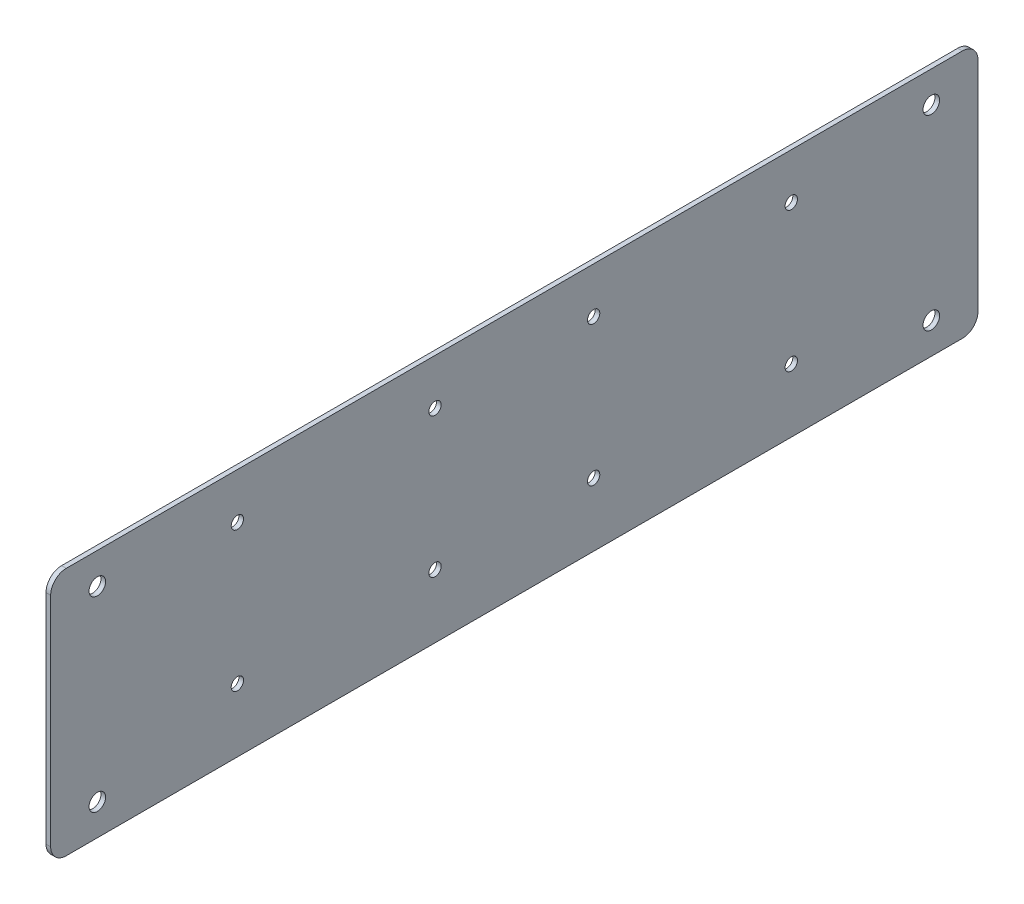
ISO-10303-21;
HEADER;
FILE_DESCRIPTION(('STEP AP214'),'2;1');
FILE_NAME('part.step','',(''),(''),'','','');
FILE_SCHEMA(('AUTOMOTIVE_DESIGN { 1 0 10303 214 1 1 1 1 }'));
ENDSEC;
DATA;
#1=APPLICATION_CONTEXT('core data for automotive mechanical design processes');
#2=APPLICATION_PROTOCOL_DEFINITION('international standard','automotive_design',2000,#1);
#3=PRODUCT_CONTEXT('',#1,'mechanical');
#4=PRODUCT('Part','Part','',(#3));
#5=PRODUCT_RELATED_PRODUCT_CATEGORY('part','',(#4));
#6=PRODUCT_DEFINITION_FORMATION('','',#4);
#7=PRODUCT_DEFINITION_CONTEXT('part definition',#1,'design');
#8=PRODUCT_DEFINITION('design','',#6,#7);
#9=PRODUCT_DEFINITION_SHAPE('','',#8);
#10=(LENGTH_UNIT() NAMED_UNIT(*) SI_UNIT(.MILLI.,.METRE.));
#11=(NAMED_UNIT(*) PLANE_ANGLE_UNIT() SI_UNIT($,.RADIAN.));
#12=(NAMED_UNIT(*) SI_UNIT($,.STERADIAN.) SOLID_ANGLE_UNIT());
#13=UNCERTAINTY_MEASURE_WITH_UNIT(LENGTH_MEASURE(1.E-05),#10,'distance_accuracy_value','');
#14=(GEOMETRIC_REPRESENTATION_CONTEXT(3) GLOBAL_UNCERTAINTY_ASSIGNED_CONTEXT((#13)) GLOBAL_UNIT_ASSIGNED_CONTEXT((#10,
#11,#12)) REPRESENTATION_CONTEXT('',''));
#15=CARTESIAN_POINT('',(0.,0.,0.));
#16=DIRECTION('',(0.,0.,1.));
#17=DIRECTION('',(1.,0.,0.));
#18=AXIS2_PLACEMENT_3D('',#15,#16,#17);
#19=CARTESIAN_POINT('',(-53.6473185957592,269.263877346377,471.998026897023));
#20=DIRECTION('',(1.,0.,0.));
#21=DIRECTION('',(0.,1.,0.));
#22=AXIS2_PLACEMENT_3D('',#19,#20,#21);
#23=CYLINDRICAL_SURFACE('',#22,6.35000000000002);
#24=CARTESIAN_POINT('',(-51.7423185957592,269.263877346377,471.998026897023));
#25=DIRECTION('',(-1.,0.,0.));
#26=DIRECTION('',(0.,1.,0.));
#27=AXIS2_PLACEMENT_3D('',#24,#25,#26);
#28=CIRCLE('',#27,6.35000000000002);
#29=CARTESIAN_POINT('',(-51.7423185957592,262.913877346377,471.998026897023));
#30=VERTEX_POINT('',#29);
#31=CARTESIAN_POINT('',(-51.7423185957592,269.263877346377,478.348026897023));
#32=VERTEX_POINT('',#31);
#33=EDGE_CURVE('E134',#30,#32,#28,.T.);
#34=ORIENTED_EDGE('',*,*,#33,.T.);
#35=DIRECTION('',(1.,0.,0.));
#36=VECTOR('',#35,1.);
#37=CARTESIAN_POINT('',(-53.6473185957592,269.263877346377,478.348026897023));
#38=LINE('',#37,#36);
#39=CARTESIAN_POINT('',(-53.6473185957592,269.263877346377,478.348026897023));
#40=VERTEX_POINT('',#39);
#41=EDGE_CURVE('E11',#40,#32,#38,.T.);
#42=ORIENTED_EDGE('',*,*,#41,.F.);
#43=CARTESIAN_POINT('',(-53.6473185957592,269.263877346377,471.998026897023));
#44=DIRECTION('',(-1.,0.,0.));
#45=DIRECTION('',(0.,1.,0.));
#46=AXIS2_PLACEMENT_3D('',#43,#44,#45);
#47=CIRCLE('',#46,6.35000000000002);
#48=CARTESIAN_POINT('',(-53.6473185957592,262.913877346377,471.998026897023));
#49=VERTEX_POINT('',#48);
#50=EDGE_CURVE('E149',#49,#40,#47,.T.);
#51=ORIENTED_EDGE('',*,*,#50,.F.);
#52=DIRECTION('',(1.,0.,0.));
#53=VECTOR('',#52,1.);
#54=CARTESIAN_POINT('',(-53.6473185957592,262.913877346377,471.998026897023));
#55=LINE('',#54,#53);
#56=EDGE_CURVE('E130',#49,#30,#55,.T.);
#57=ORIENTED_EDGE('',*,*,#56,.T.);
#58=EDGE_LOOP('',(#34,#42,#51,#57));
#59=FACE_BOUND('',#58,.T.);
#60=ADVANCED_FACE('F36',(#59),#23,.T.);
#61=CARTESIAN_POINT('',(-53.6473185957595,358.163877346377,478.348026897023));
#62=DIRECTION('',(0.,0.,-1.));
#63=DIRECTION('',(-1.,0.,0.));
#64=AXIS2_PLACEMENT_3D('',#61,#62,#63);
#65=PLANE('',#64);
#66=DIRECTION('',(0.,1.,0.));
#67=VECTOR('',#66,1.);
#68=CARTESIAN_POINT('',(-51.7423185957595,358.163877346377,478.348026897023));
#69=LINE('',#68,#67);
#70=CARTESIAN_POINT('',(-51.7423185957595,358.163877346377,478.348026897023));
#71=VERTEX_POINT('',#70);
#72=EDGE_CURVE('E137',#32,#71,#69,.T.);
#73=ORIENTED_EDGE('',*,*,#72,.T.);
#74=DIRECTION('',(1.,0.,0.));
#75=VECTOR('',#74,1.);
#76=CARTESIAN_POINT('',(-53.6473185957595,358.163877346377,478.348026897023));
#77=LINE('',#76,#75);
#78=CARTESIAN_POINT('',(-53.6473185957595,358.163877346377,478.348026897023));
#79=VERTEX_POINT('',#78);
#80=EDGE_CURVE('E45',#79,#71,#77,.T.);
#81=ORIENTED_EDGE('',*,*,#80,.F.);
#82=DIRECTION('',(0.,1.,0.));
#83=VECTOR('',#82,1.);
#84=CARTESIAN_POINT('',(-53.6473185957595,358.163877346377,478.348026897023));
#85=LINE('',#84,#83);
#86=EDGE_CURVE('E97',#40,#79,#85,.T.);
#87=ORIENTED_EDGE('',*,*,#86,.F.);
#88=ORIENTED_EDGE('',*,*,#41,.T.);
#89=EDGE_LOOP('',(#73,#81,#87,#88));
#90=FACE_BOUND('',#89,.T.);
#91=ADVANCED_FACE('F216',(#90),#65,.F.);
#92=CARTESIAN_POINT('',(-53.6473185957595,358.163877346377,471.998026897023));
#93=DIRECTION('',(1.,0.,0.));
#94=DIRECTION('',(0.,1.,0.));
#95=AXIS2_PLACEMENT_3D('',#92,#93,#94);
#96=CYLINDRICAL_SURFACE('',#95,6.35000000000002);
#97=CARTESIAN_POINT('',(-51.7423185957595,358.163877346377,471.998026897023));
#98=DIRECTION('',(-1.,0.,0.));
#99=DIRECTION('',(0.,-1.,0.));
#100=AXIS2_PLACEMENT_3D('',#97,#98,#99);
#101=CIRCLE('',#100,6.35000000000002);
#102=CARTESIAN_POINT('',(-51.7423185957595,364.513877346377,471.998026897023));
#103=VERTEX_POINT('',#102);
#104=EDGE_CURVE('E140',#71,#103,#101,.T.);
#105=ORIENTED_EDGE('',*,*,#104,.T.);
#106=DIRECTION('',(1.,0.,0.));
#107=VECTOR('',#106,1.);
#108=CARTESIAN_POINT('',(-53.6473185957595,364.513877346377,471.998026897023));
#109=LINE('',#108,#107);
#110=CARTESIAN_POINT('',(-53.6473185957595,364.513877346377,471.998026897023));
#111=VERTEX_POINT('',#110);
#112=EDGE_CURVE('E156',#111,#103,#109,.T.);
#113=ORIENTED_EDGE('',*,*,#112,.F.);
#114=CARTESIAN_POINT('',(-53.6473185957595,358.163877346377,471.998026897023));
#115=DIRECTION('',(-1.,0.,0.));
#116=DIRECTION('',(0.,-1.,0.));
#117=AXIS2_PLACEMENT_3D('',#114,#115,#116);
#118=CIRCLE('',#117,6.35000000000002);
#119=EDGE_CURVE('E184',#79,#111,#118,.T.);
#120=ORIENTED_EDGE('',*,*,#119,.F.);
#121=ORIENTED_EDGE('',*,*,#80,.T.);
#122=EDGE_LOOP('',(#105,#113,#120,#121));
#123=FACE_BOUND('',#122,.T.);
#124=ADVANCED_FACE('F220',(#123),#96,.T.);
#125=CARTESIAN_POINT('',(-53.6473185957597,364.513877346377,106.238026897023));
#126=DIRECTION('',(0.,-1.,0.));
#127=DIRECTION('',(1.,0.,0.));
#128=AXIS2_PLACEMENT_3D('',#125,#126,#127);
#129=PLANE('',#128);
#130=DIRECTION('',(0.,0.,-1.));
#131=VECTOR('',#130,1.);
#132=CARTESIAN_POINT('',(-51.7423185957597,364.513877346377,106.238026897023));
#133=LINE('',#132,#131);
#134=CARTESIAN_POINT('',(-51.7423185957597,364.513877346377,106.238026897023));
#135=VERTEX_POINT('',#134);
#136=EDGE_CURVE('E142',#103,#135,#133,.T.);
#137=ORIENTED_EDGE('',*,*,#136,.T.);
#138=DIRECTION('',(1.,0.,0.));
#139=VECTOR('',#138,1.);
#140=CARTESIAN_POINT('',(-53.6473185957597,364.513877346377,106.238026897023));
#141=LINE('',#140,#139);
#142=CARTESIAN_POINT('',(-53.6473185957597,364.513877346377,106.238026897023));
#143=VERTEX_POINT('',#142);
#144=EDGE_CURVE('E153',#143,#135,#141,.T.);
#145=ORIENTED_EDGE('',*,*,#144,.F.);
#146=DIRECTION('',(0.,0.,-1.));
#147=VECTOR('',#146,1.);
#148=CARTESIAN_POINT('',(-53.6473185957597,364.513877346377,106.238026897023));
#149=LINE('',#148,#147);
#150=EDGE_CURVE('E186',#111,#143,#149,.T.);
#151=ORIENTED_EDGE('',*,*,#150,.F.);
#152=ORIENTED_EDGE('',*,*,#112,.T.);
#153=EDGE_LOOP('',(#137,#145,#151,#152));
#154=FACE_BOUND('',#153,.T.);
#155=ADVANCED_FACE('F192',(#154),#129,.F.);
#156=CARTESIAN_POINT('',(-53.6473185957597,358.163877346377,106.238026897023));
#157=DIRECTION('',(1.,0.,0.));
#158=DIRECTION('',(0.,1.,0.));
#159=AXIS2_PLACEMENT_3D('',#156,#157,#158);
#160=CYLINDRICAL_SURFACE('',#159,6.35000000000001);
#161=CARTESIAN_POINT('',(-51.7423185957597,358.163877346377,106.238026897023));
#162=DIRECTION('',(-1.,0.,0.));
#163=DIRECTION('',(0.,1.,0.));
#164=AXIS2_PLACEMENT_3D('',#161,#162,#163);
#165=CIRCLE('',#164,6.35000000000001);
#166=CARTESIAN_POINT('',(-51.7423185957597,358.163877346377,99.8880268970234));
#167=VERTEX_POINT('',#166);
#168=EDGE_CURVE('E144',#135,#167,#165,.T.);
#169=ORIENTED_EDGE('',*,*,#168,.T.);
#170=DIRECTION('',(1.,0.,0.));
#171=VECTOR('',#170,1.);
#172=CARTESIAN_POINT('',(-53.6473185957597,358.163877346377,99.8880268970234));
#173=LINE('',#172,#171);
#174=CARTESIAN_POINT('',(-53.6473185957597,358.163877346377,99.8880268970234));
#175=VERTEX_POINT('',#174);
#176=EDGE_CURVE('E125',#175,#167,#173,.T.);
#177=ORIENTED_EDGE('',*,*,#176,.F.);
#178=CARTESIAN_POINT('',(-53.6473185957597,358.163877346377,106.238026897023));
#179=DIRECTION('',(-1.,0.,0.));
#180=DIRECTION('',(0.,1.,0.));
#181=AXIS2_PLACEMENT_3D('',#178,#179,#180);
#182=CIRCLE('',#181,6.35000000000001);
#183=EDGE_CURVE('E116',#143,#175,#182,.T.);
#184=ORIENTED_EDGE('',*,*,#183,.F.);
#185=ORIENTED_EDGE('',*,*,#144,.T.);
#186=EDGE_LOOP('',(#169,#177,#184,#185));
#187=FACE_BOUND('',#186,.T.);
#188=ADVANCED_FACE('F196',(#187),#160,.T.);
#189=CARTESIAN_POINT('',(-53.6473185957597,358.163877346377,99.8880268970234));
#190=DIRECTION('',(0.,0.,1.));
#191=DIRECTION('',(0.,-1.,0.));
#192=AXIS2_PLACEMENT_3D('',#189,#190,#191);
#193=PLANE('',#192);
#194=DIRECTION('',(0.,-1.,0.));
#195=VECTOR('',#194,1.);
#196=CARTESIAN_POINT('',(-51.7423185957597,358.163877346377,99.8880268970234));
#197=LINE('',#196,#195);
#198=CARTESIAN_POINT('',(-51.7423185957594,269.263877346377,99.8880268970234));
#199=VERTEX_POINT('',#198);
#200=EDGE_CURVE('E124',#167,#199,#197,.T.);
#201=ORIENTED_EDGE('',*,*,#200,.T.);
#202=DIRECTION('',(1.,0.,0.));
#203=VECTOR('',#202,1.);
#204=CARTESIAN_POINT('',(-53.6473185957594,269.263877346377,99.8880268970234));
#205=LINE('',#204,#203);
#206=CARTESIAN_POINT('',(-53.6473185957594,269.263877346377,99.8880268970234));
#207=VERTEX_POINT('',#206);
#208=EDGE_CURVE('E121',#207,#199,#205,.T.);
#209=ORIENTED_EDGE('',*,*,#208,.F.);
#210=DIRECTION('',(0.,-1.,0.));
#211=VECTOR('',#210,1.);
#212=CARTESIAN_POINT('',(-53.6473185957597,358.163877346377,99.8880268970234));
#213=LINE('',#212,#211);
#214=EDGE_CURVE('E110',#175,#207,#213,.T.);
#215=ORIENTED_EDGE('',*,*,#214,.F.);
#216=ORIENTED_EDGE('',*,*,#176,.T.);
#217=EDGE_LOOP('',(#201,#209,#215,#216));
#218=FACE_BOUND('',#217,.T.);
#219=ADVANCED_FACE('F122',(#218),#193,.F.);
#220=CARTESIAN_POINT('',(-53.6473185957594,269.263877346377,106.238026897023));
#221=DIRECTION('',(1.,0.,0.));
#222=DIRECTION('',(0.,1.,0.));
#223=AXIS2_PLACEMENT_3D('',#220,#221,#222);
#224=CYLINDRICAL_SURFACE('',#223,6.35000000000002);
#225=CARTESIAN_POINT('',(-51.7423185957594,269.263877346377,106.238026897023));
#226=DIRECTION('',(-1.,0.,0.));
#227=DIRECTION('',(0.,-1.,0.));
#228=AXIS2_PLACEMENT_3D('',#225,#226,#227);
#229=CIRCLE('',#228,6.35000000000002);
#230=CARTESIAN_POINT('',(-51.7423185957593,262.913877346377,106.238026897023));
#231=VERTEX_POINT('',#230);
#232=EDGE_CURVE('E83',#199,#231,#229,.T.);
#233=ORIENTED_EDGE('',*,*,#232,.T.);
#234=DIRECTION('',(1.,0.,0.));
#235=VECTOR('',#234,1.);
#236=CARTESIAN_POINT('',(-53.6473185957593,262.913877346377,106.238026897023));
#237=LINE('',#236,#235);
#238=CARTESIAN_POINT('',(-53.6473185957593,262.913877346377,106.238026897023));
#239=VERTEX_POINT('',#238);
#240=EDGE_CURVE('E126',#239,#231,#237,.T.);
#241=ORIENTED_EDGE('',*,*,#240,.F.);
#242=CARTESIAN_POINT('',(-53.6473185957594,269.263877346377,106.238026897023));
#243=DIRECTION('',(-1.,0.,0.));
#244=DIRECTION('',(0.,-1.,0.));
#245=AXIS2_PLACEMENT_3D('',#242,#243,#244);
#246=CIRCLE('',#245,6.35000000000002);
#247=EDGE_CURVE('E114',#207,#239,#246,.T.);
#248=ORIENTED_EDGE('',*,*,#247,.F.);
#249=ORIENTED_EDGE('',*,*,#208,.T.);
#250=EDGE_LOOP('',(#233,#241,#248,#249));
#251=FACE_BOUND('',#250,.T.);
#252=ADVANCED_FACE('F128',(#251),#224,.T.);
#253=CARTESIAN_POINT('',(-53.6473185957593,262.913877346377,106.238026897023));
#254=DIRECTION('',(0.,1.,0.));
#255=DIRECTION('',(-1.,0.,0.));
#256=AXIS2_PLACEMENT_3D('',#253,#254,#255);
#257=PLANE('',#256);
#258=DIRECTION('',(0.,0.,1.));
#259=VECTOR('',#258,1.);
#260=CARTESIAN_POINT('',(-51.7423185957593,262.913877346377,106.238026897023));
#261=LINE('',#260,#259);
#262=EDGE_CURVE('E89',#231,#30,#261,.T.);
#263=ORIENTED_EDGE('',*,*,#262,.T.);
#264=ORIENTED_EDGE('',*,*,#56,.F.);
#265=DIRECTION('',(0.,0.,1.));
#266=VECTOR('',#265,1.);
#267=CARTESIAN_POINT('',(-53.6473185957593,262.913877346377,106.238026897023));
#268=LINE('',#267,#266);
#269=EDGE_CURVE('E54',#239,#49,#268,.T.);
#270=ORIENTED_EDGE('',*,*,#269,.F.);
#271=ORIENTED_EDGE('',*,*,#240,.T.);
#272=EDGE_LOOP('',(#263,#264,#270,#271));
#273=FACE_BOUND('',#272,.T.);
#274=ADVANCED_FACE('F204',(#273),#257,.F.);
#275=CARTESIAN_POINT('',(-53.6473185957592,269.263877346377,471.998026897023));
#276=DIRECTION('',(1.,0.,0.));
#277=DIRECTION('',(0.,1.,0.));
#278=AXIS2_PLACEMENT_3D('',#275,#276,#277);
#279=PLANE('',#278);
#280=CARTESIAN_POINT('',(-53.6473185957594,288.796477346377,176.088026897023));
#281=DIRECTION('',(1.,0.,0.));
#282=DIRECTION('',(0.,1.,0.));
#283=AXIS2_PLACEMENT_3D('',#280,#281,#282);
#284=CIRCLE('',#283,2.51460000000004);
#285=CARTESIAN_POINT('',(-53.6473185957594,286.281877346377,176.088026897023));
#286=VERTEX_POINT('',#285);
#287=EDGE_CURVE('E386',#286,#286,#284,.T.);
#288=ORIENTED_EDGE('',*,*,#287,.T.);
#289=EDGE_LOOP('',(#288));
#290=FACE_BOUND('',#289,.T.);
#291=CARTESIAN_POINT('',(-53.6473185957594,288.796477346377,256.758426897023));
#292=DIRECTION('',(1.,0.,0.));
#293=DIRECTION('',(0.,1.,0.));
#294=AXIS2_PLACEMENT_3D('',#291,#292,#293);
#295=CIRCLE('',#294,2.51460000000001);
#296=CARTESIAN_POINT('',(-53.6473185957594,286.281877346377,256.758426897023));
#297=VERTEX_POINT('',#296);
#298=EDGE_CURVE('E388',#297,#297,#295,.T.);
#299=ORIENTED_EDGE('',*,*,#298,.T.);
#300=EDGE_LOOP('',(#299));
#301=FACE_BOUND('',#300,.T.);
#302=CARTESIAN_POINT('',(-53.6473185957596,345.844877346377,256.758426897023));
#303=DIRECTION('',(1.,0.,0.));
#304=DIRECTION('',(0.,1.,0.));
#305=AXIS2_PLACEMENT_3D('',#302,#303,#304);
#306=CIRCLE('',#305,2.51460000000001);
#307=CARTESIAN_POINT('',(-53.6473185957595,343.330277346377,256.758426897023));
#308=VERTEX_POINT('',#307);
#309=EDGE_CURVE('E394',#308,#308,#306,.T.);
#310=ORIENTED_EDGE('',*,*,#309,.T.);
#311=EDGE_LOOP('',(#310));
#312=FACE_BOUND('',#311,.T.);
#313=CARTESIAN_POINT('',(-53.6473185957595,345.844877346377,321.477626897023));
#314=DIRECTION('',(1.,0.,0.));
#315=DIRECTION('',(0.,1.,0.));
#316=AXIS2_PLACEMENT_3D('',#313,#314,#315);
#317=CIRCLE('',#316,2.5145999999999);
#318=CARTESIAN_POINT('',(-53.6473185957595,343.330277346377,321.477626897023));
#319=VERTEX_POINT('',#318);
#320=EDGE_CURVE('E418',#319,#319,#317,.T.);
#321=ORIENTED_EDGE('',*,*,#320,.T.);
#322=EDGE_LOOP('',(#321));
#323=FACE_BOUND('',#322,.T.);
#324=CARTESIAN_POINT('',(-53.6473185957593,288.796477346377,321.477626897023));
#325=DIRECTION('',(1.,0.,0.));
#326=DIRECTION('',(0.,1.,0.));
#327=AXIS2_PLACEMENT_3D('',#324,#325,#326);
#328=CIRCLE('',#327,2.51460000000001);
#329=CARTESIAN_POINT('',(-53.6473185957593,286.281877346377,321.477626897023));
#330=VERTEX_POINT('',#329);
#331=EDGE_CURVE('E421',#330,#330,#328,.T.);
#332=ORIENTED_EDGE('',*,*,#331,.T.);
#333=EDGE_LOOP('',(#332));
#334=FACE_BOUND('',#333,.T.);
#335=CARTESIAN_POINT('',(-53.6473185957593,288.796477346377,402.148026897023));
#336=DIRECTION('',(1.,0.,0.));
#337=DIRECTION('',(0.,1.,0.));
#338=AXIS2_PLACEMENT_3D('',#335,#336,#337);
#339=CIRCLE('',#338,2.51460000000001);
#340=CARTESIAN_POINT('',(-53.6473185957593,286.281877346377,402.148026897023));
#341=VERTEX_POINT('',#340);
#342=EDGE_CURVE('E424',#341,#341,#339,.T.);
#343=ORIENTED_EDGE('',*,*,#342,.T.);
#344=EDGE_LOOP('',(#343));
#345=FACE_BOUND('',#344,.T.);
#346=CARTESIAN_POINT('',(-53.6473185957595,345.844877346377,402.148026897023));
#347=DIRECTION('',(1.,0.,0.));
#348=DIRECTION('',(0.,1.,0.));
#349=AXIS2_PLACEMENT_3D('',#346,#347,#348);
#350=CIRCLE('',#349,2.51460000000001);
#351=CARTESIAN_POINT('',(-53.6473185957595,343.330277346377,402.148026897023));
#352=VERTEX_POINT('',#351);
#353=EDGE_CURVE('E427',#352,#352,#350,.T.);
#354=ORIENTED_EDGE('',*,*,#353,.T.);
#355=EDGE_LOOP('',(#354));
#356=FACE_BOUND('',#355,.T.);
#357=CARTESIAN_POINT('',(-53.6473185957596,345.844877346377,176.088026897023));
#358=DIRECTION('',(1.,0.,0.));
#359=DIRECTION('',(0.,1.,0.));
#360=AXIS2_PLACEMENT_3D('',#357,#358,#359);
#361=CIRCLE('',#360,2.51459999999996);
#362=CARTESIAN_POINT('',(-53.6473185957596,343.330277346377,176.088026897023));
#363=VERTEX_POINT('',#362);
#364=EDGE_CURVE('E391',#363,#363,#361,.T.);
#365=ORIENTED_EDGE('',*,*,#364,.T.);
#366=EDGE_LOOP('',(#365));
#367=FACE_BOUND('',#366,.T.);
#368=CARTESIAN_POINT('',(-53.6473185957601,351.813877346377,118.938026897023));
#369=DIRECTION('',(1.,0.,0.));
#370=DIRECTION('',(0.,1.,0.));
#371=AXIS2_PLACEMENT_3D('',#368,#369,#370);
#372=CIRCLE('',#371,3.37819999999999);
#373=CARTESIAN_POINT('',(-53.6473185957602,355.192077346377,118.938026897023));
#374=VERTEX_POINT('',#373);
#375=EDGE_CURVE('E167',#374,#374,#372,.T.);
#376=ORIENTED_EDGE('',*,*,#375,.T.);
#377=EDGE_LOOP('',(#376));
#378=FACE_BOUND('',#377,.T.);
#379=CARTESIAN_POINT('',(-53.6473185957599,275.613877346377,118.938026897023));
#380=DIRECTION('',(1.,0.,0.));
#381=DIRECTION('',(0.,1.,0.));
#382=AXIS2_PLACEMENT_3D('',#379,#380,#381);
#383=CIRCLE('',#382,3.37819999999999);
#384=CARTESIAN_POINT('',(-53.6473185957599,278.992077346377,118.938026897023));
#385=VERTEX_POINT('',#384);
#386=EDGE_CURVE('E401',#385,#385,#383,.T.);
#387=ORIENTED_EDGE('',*,*,#386,.T.);
#388=EDGE_LOOP('',(#387));
#389=FACE_BOUND('',#388,.T.);
#390=CARTESIAN_POINT('',(-53.6473185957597,275.613877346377,459.298026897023));
#391=DIRECTION('',(1.,0.,0.));
#392=DIRECTION('',(0.,1.,0.));
#393=AXIS2_PLACEMENT_3D('',#390,#391,#392);
#394=CIRCLE('',#393,3.37819999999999);
#395=CARTESIAN_POINT('',(-53.6473185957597,278.992077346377,459.298026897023));
#396=VERTEX_POINT('',#395);
#397=EDGE_CURVE('E180',#396,#396,#394,.T.);
#398=ORIENTED_EDGE('',*,*,#397,.T.);
#399=EDGE_LOOP('',(#398));
#400=FACE_BOUND('',#399,.T.);
#401=CARTESIAN_POINT('',(-53.64731859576,351.813877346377,459.298026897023));
#402=DIRECTION('',(1.,0.,0.));
#403=DIRECTION('',(0.,1.,0.));
#404=AXIS2_PLACEMENT_3D('',#401,#402,#403);
#405=CIRCLE('',#404,3.37819999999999);
#406=CARTESIAN_POINT('',(-53.64731859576,355.192077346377,459.298026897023));
#407=VERTEX_POINT('',#406);
#408=EDGE_CURVE('E163',#407,#407,#405,.T.);
#409=ORIENTED_EDGE('',*,*,#408,.T.);
#410=EDGE_LOOP('',(#409));
#411=FACE_BOUND('',#410,.T.);
#412=ORIENTED_EDGE('',*,*,#50,.T.);
#413=ORIENTED_EDGE('',*,*,#86,.T.);
#414=ORIENTED_EDGE('',*,*,#119,.T.);
#415=ORIENTED_EDGE('',*,*,#150,.T.);
#416=ORIENTED_EDGE('',*,*,#183,.T.);
#417=ORIENTED_EDGE('',*,*,#214,.T.);
#418=ORIENTED_EDGE('',*,*,#247,.T.);
#419=ORIENTED_EDGE('',*,*,#269,.T.);
#420=EDGE_LOOP('',(#412,#413,#414,#415,#416,#417,#418,#419));
#421=FACE_BOUND('',#420,.T.);
#422=ADVANCED_FACE('F112',(#290,#301,#312,#323,#334,#345,#356,#367,#378,#389,#400,#411,#421),
#279,.F.);
#423=CARTESIAN_POINT('',(-51.7423185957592,269.263877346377,471.998026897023));
#424=DIRECTION('',(1.,0.,0.));
#425=DIRECTION('',(0.,1.,0.));
#426=AXIS2_PLACEMENT_3D('',#423,#424,#425);
#427=PLANE('',#426);
#428=CARTESIAN_POINT('',(-51.7423185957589,288.796477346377,176.088026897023));
#429=DIRECTION('',(-1.,0.,0.));
#430=DIRECTION('',(0.,-1.,0.));
#431=AXIS2_PLACEMENT_3D('',#428,#429,#430);
#432=CIRCLE('',#431,2.51460000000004);
#433=CARTESIAN_POINT('',(-51.7423185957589,286.281877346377,176.088026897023));
#434=VERTEX_POINT('',#433);
#435=EDGE_CURVE('E383',#434,#434,#432,.T.);
#436=ORIENTED_EDGE('',*,*,#435,.T.);
#437=EDGE_LOOP('',(#436));
#438=FACE_BOUND('',#437,.T.);
#439=CARTESIAN_POINT('',(-51.7423185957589,288.796477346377,256.758426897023));
#440=DIRECTION('',(-1.,0.,0.));
#441=DIRECTION('',(0.,-1.,0.));
#442=AXIS2_PLACEMENT_3D('',#439,#440,#441);
#443=CIRCLE('',#442,2.51460000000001);
#444=CARTESIAN_POINT('',(-51.7423185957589,286.281877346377,256.758426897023));
#445=VERTEX_POINT('',#444);
#446=EDGE_CURVE('E445',#445,#445,#443,.T.);
#447=ORIENTED_EDGE('',*,*,#446,.T.);
#448=EDGE_LOOP('',(#447));
#449=FACE_BOUND('',#448,.T.);
#450=CARTESIAN_POINT('',(-51.7423185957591,345.844877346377,256.758426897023));
#451=DIRECTION('',(-1.,0.,0.));
#452=DIRECTION('',(0.,-1.,0.));
#453=AXIS2_PLACEMENT_3D('',#450,#451,#452);
#454=CIRCLE('',#453,2.51460000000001);
#455=CARTESIAN_POINT('',(-51.7423185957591,343.330277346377,256.758426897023));
#456=VERTEX_POINT('',#455);
#457=EDGE_CURVE('E442',#456,#456,#454,.T.);
#458=ORIENTED_EDGE('',*,*,#457,.T.);
#459=EDGE_LOOP('',(#458));
#460=FACE_BOUND('',#459,.T.);
#461=CARTESIAN_POINT('',(-51.742318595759,345.844877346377,321.477626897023));
#462=DIRECTION('',(-1.,0.,0.));
#463=DIRECTION('',(0.,-1.,0.));
#464=AXIS2_PLACEMENT_3D('',#461,#462,#463);
#465=CIRCLE('',#464,2.5145999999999);
#466=CARTESIAN_POINT('',(-51.742318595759,343.330277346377,321.477626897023));
#467=VERTEX_POINT('',#466);
#468=EDGE_CURVE('E439',#467,#467,#465,.T.);
#469=ORIENTED_EDGE('',*,*,#468,.T.);
#470=EDGE_LOOP('',(#469));
#471=FACE_BOUND('',#470,.T.);
#472=CARTESIAN_POINT('',(-51.7423185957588,288.796477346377,321.477626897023));
#473=DIRECTION('',(-1.,0.,0.));
#474=DIRECTION('',(0.,-1.,0.));
#475=AXIS2_PLACEMENT_3D('',#472,#473,#474);
#476=CIRCLE('',#475,2.51460000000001);
#477=CARTESIAN_POINT('',(-51.7423185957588,286.281877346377,321.477626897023));
#478=VERTEX_POINT('',#477);
#479=EDGE_CURVE('E436',#478,#478,#476,.T.);
#480=ORIENTED_EDGE('',*,*,#479,.T.);
#481=EDGE_LOOP('',(#480));
#482=FACE_BOUND('',#481,.T.);
#483=CARTESIAN_POINT('',(-51.7423185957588,288.796477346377,402.148026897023));
#484=DIRECTION('',(-1.,0.,0.));
#485=DIRECTION('',(0.,-1.,0.));
#486=AXIS2_PLACEMENT_3D('',#483,#484,#485);
#487=CIRCLE('',#486,2.51460000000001);
#488=CARTESIAN_POINT('',(-51.7423185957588,286.281877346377,402.148026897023));
#489=VERTEX_POINT('',#488);
#490=EDGE_CURVE('E433',#489,#489,#487,.T.);
#491=ORIENTED_EDGE('',*,*,#490,.T.);
#492=EDGE_LOOP('',(#491));
#493=FACE_BOUND('',#492,.T.);
#494=CARTESIAN_POINT('',(-51.742318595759,345.844877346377,402.148026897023));
#495=DIRECTION('',(-1.,0.,0.));
#496=DIRECTION('',(0.,-1.,0.));
#497=AXIS2_PLACEMENT_3D('',#494,#495,#496);
#498=CIRCLE('',#497,2.51460000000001);
#499=CARTESIAN_POINT('',(-51.742318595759,343.330277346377,402.148026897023));
#500=VERTEX_POINT('',#499);
#501=EDGE_CURVE('E430',#500,#500,#498,.T.);
#502=ORIENTED_EDGE('',*,*,#501,.T.);
#503=EDGE_LOOP('',(#502));
#504=FACE_BOUND('',#503,.T.);
#505=CARTESIAN_POINT('',(-51.7423185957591,345.844877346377,176.088026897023));
#506=DIRECTION('',(-1.,0.,0.));
#507=DIRECTION('',(0.,-1.,0.));
#508=AXIS2_PLACEMENT_3D('',#505,#506,#507);
#509=CIRCLE('',#508,2.51459999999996);
#510=CARTESIAN_POINT('',(-51.7423185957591,343.330277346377,176.088026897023));
#511=VERTEX_POINT('',#510);
#512=EDGE_CURVE('E387',#511,#511,#509,.T.);
#513=ORIENTED_EDGE('',*,*,#512,.T.);
#514=EDGE_LOOP('',(#513));
#515=FACE_BOUND('',#514,.T.);
#516=CARTESIAN_POINT('',(-51.7423185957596,351.813877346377,118.938026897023));
#517=DIRECTION('',(1.,0.,0.));
#518=DIRECTION('',(0.,1.,0.));
#519=AXIS2_PLACEMENT_3D('',#516,#517,#518);
#520=CIRCLE('',#519,3.37819999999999);
#521=CARTESIAN_POINT('',(-51.7423185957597,355.192077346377,118.938026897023));
#522=VERTEX_POINT('',#521);
#523=EDGE_CURVE('E39',#522,#522,#520,.T.);
#524=ORIENTED_EDGE('',*,*,#523,.F.);
#525=EDGE_LOOP('',(#524));
#526=FACE_BOUND('',#525,.T.);
#527=CARTESIAN_POINT('',(-51.7423185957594,275.613877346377,118.938026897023));
#528=DIRECTION('',(1.,0.,0.));
#529=DIRECTION('',(0.,1.,0.));
#530=AXIS2_PLACEMENT_3D('',#527,#528,#529);
#531=CIRCLE('',#530,3.37819999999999);
#532=CARTESIAN_POINT('',(-51.7423185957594,278.992077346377,118.938026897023));
#533=VERTEX_POINT('',#532);
#534=EDGE_CURVE('E166',#533,#533,#531,.T.);
#535=ORIENTED_EDGE('',*,*,#534,.F.);
#536=EDGE_LOOP('',(#535));
#537=FACE_BOUND('',#536,.T.);
#538=CARTESIAN_POINT('',(-51.7423185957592,275.613877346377,459.298026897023));
#539=DIRECTION('',(1.,0.,0.));
#540=DIRECTION('',(0.,1.,0.));
#541=AXIS2_PLACEMENT_3D('',#538,#539,#540);
#542=CIRCLE('',#541,3.37819999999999);
#543=CARTESIAN_POINT('',(-51.7423185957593,278.992077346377,459.298026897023));
#544=VERTEX_POINT('',#543);
#545=EDGE_CURVE('E164',#544,#544,#542,.T.);
#546=ORIENTED_EDGE('',*,*,#545,.F.);
#547=EDGE_LOOP('',(#546));
#548=FACE_BOUND('',#547,.T.);
#549=CARTESIAN_POINT('',(-51.7423185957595,351.813877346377,459.298026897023));
#550=DIRECTION('',(1.,0.,0.));
#551=DIRECTION('',(0.,1.,0.));
#552=AXIS2_PLACEMENT_3D('',#549,#550,#551);
#553=CIRCLE('',#552,3.37819999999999);
#554=CARTESIAN_POINT('',(-51.7423185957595,355.192077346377,459.298026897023));
#555=VERTEX_POINT('',#554);
#556=EDGE_CURVE('E138',#555,#555,#553,.T.);
#557=ORIENTED_EDGE('',*,*,#556,.F.);
#558=EDGE_LOOP('',(#557));
#559=FACE_BOUND('',#558,.T.);
#560=ORIENTED_EDGE('',*,*,#33,.F.);
#561=ORIENTED_EDGE('',*,*,#262,.F.);
#562=ORIENTED_EDGE('',*,*,#232,.F.);
#563=ORIENTED_EDGE('',*,*,#200,.F.);
#564=ORIENTED_EDGE('',*,*,#168,.F.);
#565=ORIENTED_EDGE('',*,*,#136,.F.);
#566=ORIENTED_EDGE('',*,*,#104,.F.);
#567=ORIENTED_EDGE('',*,*,#72,.F.);
#568=EDGE_LOOP('',(#560,#561,#562,#563,#564,#565,#566,#567));
#569=FACE_BOUND('',#568,.T.);
#570=ADVANCED_FACE('F199',(#438,#449,#460,#471,#482,#493,#504,#515,#526,#537,#548,#559,#569),
#427,.T.);
#571=CARTESIAN_POINT('',(-53.64731859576,351.813877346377,459.298026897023));
#572=DIRECTION('',(1.,0.,0.));
#573=DIRECTION('',(0.,1.,0.));
#574=AXIS2_PLACEMENT_3D('',#571,#572,#573);
#575=CYLINDRICAL_SURFACE('',#574,3.37819999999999);
#576=CARTESIAN_POINT('',(-51.7423185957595,355.192077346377,459.298026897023));
#577=CARTESIAN_POINT('',(-51.7621623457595,355.192077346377,459.298026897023));
#578=CARTESIAN_POINT('',(-51.7820060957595,355.192077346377,459.298026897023));
#579=CARTESIAN_POINT('',(-51.8216935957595,355.192077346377,459.298026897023));
#580=CARTESIAN_POINT('',(-51.8415373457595,355.192077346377,459.298026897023));
#581=CARTESIAN_POINT('',(-51.8812248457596,355.192077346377,459.298026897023));
#582=CARTESIAN_POINT('',(-51.9010685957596,355.192077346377,459.298026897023));
#583=CARTESIAN_POINT('',(-51.9407560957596,355.192077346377,459.298026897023));
#584=CARTESIAN_POINT('',(-51.9605998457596,355.192077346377,459.298026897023));
#585=CARTESIAN_POINT('',(-52.0002873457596,355.192077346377,459.298026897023));
#586=CARTESIAN_POINT('',(-52.0201310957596,355.192077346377,459.298026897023));
#587=CARTESIAN_POINT('',(-52.0598185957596,355.192077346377,459.298026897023));
#588=CARTESIAN_POINT('',(-52.0796623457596,355.192077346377,459.298026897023));
#589=CARTESIAN_POINT('',(-52.1193498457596,355.192077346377,459.298026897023));
#590=CARTESIAN_POINT('',(-52.1391935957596,355.192077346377,459.298026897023));
#591=CARTESIAN_POINT('',(-52.1788810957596,355.192077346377,459.298026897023));
#592=CARTESIAN_POINT('',(-52.1987248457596,355.192077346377,459.298026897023));
#593=CARTESIAN_POINT('',(-52.2384123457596,355.192077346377,459.298026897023));
#594=CARTESIAN_POINT('',(-52.2582560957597,355.192077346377,459.298026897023));
#595=CARTESIAN_POINT('',(-52.2979435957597,355.192077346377,459.298026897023));
#596=CARTESIAN_POINT('',(-52.3177873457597,355.192077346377,459.298026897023));
#597=CARTESIAN_POINT('',(-52.3574748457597,355.192077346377,459.298026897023));
#598=CARTESIAN_POINT('',(-52.3773185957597,355.192077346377,459.298026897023));
#599=CARTESIAN_POINT('',(-52.4170060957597,355.192077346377,459.298026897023));
#600=CARTESIAN_POINT('',(-52.4368498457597,355.192077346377,459.298026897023));
#601=CARTESIAN_POINT('',(-52.4765373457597,355.192077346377,459.298026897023));
#602=CARTESIAN_POINT('',(-52.4963810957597,355.192077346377,459.298026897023));
#603=CARTESIAN_POINT('',(-52.5360685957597,355.192077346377,459.298026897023));
#604=CARTESIAN_POINT('',(-52.5559123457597,355.192077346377,459.298026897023));
#605=CARTESIAN_POINT('',(-52.5955998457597,355.192077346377,459.298026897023));
#606=CARTESIAN_POINT('',(-52.6154435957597,355.192077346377,459.298026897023));
#607=CARTESIAN_POINT('',(-52.6551310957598,355.192077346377,459.298026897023));
#608=CARTESIAN_POINT('',(-52.6749748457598,355.192077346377,459.298026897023));
#609=CARTESIAN_POINT('',(-52.7146623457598,355.192077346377,459.298026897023));
#610=CARTESIAN_POINT('',(-52.7345060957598,355.192077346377,459.298026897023));
#611=CARTESIAN_POINT('',(-52.7741935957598,355.192077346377,459.298026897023));
#612=CARTESIAN_POINT('',(-52.7940373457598,355.192077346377,459.298026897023));
#613=CARTESIAN_POINT('',(-52.8337248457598,355.192077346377,459.298026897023));
#614=CARTESIAN_POINT('',(-52.8535685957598,355.192077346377,459.298026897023));
#615=CARTESIAN_POINT('',(-52.8932560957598,355.192077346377,459.298026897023));
#616=CARTESIAN_POINT('',(-52.9130998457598,355.192077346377,459.298026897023));
#617=CARTESIAN_POINT('',(-52.9527873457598,355.192077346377,459.298026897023));
#618=CARTESIAN_POINT('',(-52.9726310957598,355.192077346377,459.298026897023));
#619=CARTESIAN_POINT('',(-53.0123185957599,355.192077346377,459.298026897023));
#620=CARTESIAN_POINT('',(-53.0321623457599,355.192077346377,459.298026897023));
#621=CARTESIAN_POINT('',(-53.0718498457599,355.192077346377,459.298026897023));
#622=CARTESIAN_POINT('',(-53.0916935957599,355.192077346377,459.298026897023));
#623=CARTESIAN_POINT('',(-53.1313810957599,355.192077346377,459.298026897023));
#624=CARTESIAN_POINT('',(-53.1512248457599,355.192077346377,459.298026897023));
#625=CARTESIAN_POINT('',(-53.1909123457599,355.192077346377,459.298026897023));
#626=CARTESIAN_POINT('',(-53.2107560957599,355.192077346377,459.298026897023));
#627=CARTESIAN_POINT('',(-53.2504435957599,355.192077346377,459.298026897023));
#628=CARTESIAN_POINT('',(-53.2702873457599,355.192077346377,459.298026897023));
#629=CARTESIAN_POINT('',(-53.3099748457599,355.192077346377,459.298026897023));
#630=CARTESIAN_POINT('',(-53.3298185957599,355.192077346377,459.298026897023));
#631=CARTESIAN_POINT('',(-53.3695060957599,355.192077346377,459.298026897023));
#632=CARTESIAN_POINT('',(-53.38934984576,355.192077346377,459.298026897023));
#633=CARTESIAN_POINT('',(-53.42903734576,355.192077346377,459.298026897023));
#634=CARTESIAN_POINT('',(-53.44888109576,355.192077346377,459.298026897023));
#635=CARTESIAN_POINT('',(-53.48856859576,355.192077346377,459.298026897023));
#636=CARTESIAN_POINT('',(-53.50841234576,355.192077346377,459.298026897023));
#637=CARTESIAN_POINT('',(-53.54809984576,355.192077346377,459.298026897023));
#638=CARTESIAN_POINT('',(-53.56794359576,355.192077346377,459.298026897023));
#639=CARTESIAN_POINT('',(-53.60763109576,355.192077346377,459.298026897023));
#640=CARTESIAN_POINT('',(-53.62747484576,355.192077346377,459.298026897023));
#641=CARTESIAN_POINT('',(-53.64731859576,355.192077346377,459.298026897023));
#642=B_SPLINE_CURVE_WITH_KNOTS('',3,(#576,#577,#578,#579,#580,#581,#582,#583,#584,#585,#586,
#587,#588,#589,#590,#591,#592,#593,#594,#595,#596,#597,#598,#599,#600,#601,#602,#603,#604,#605,
#606,#607,#608,#609,#610,#611,#612,#613,#614,#615,#616,#617,#618,#619,#620,#621,#622,#623,#624,
#625,#626,#627,#628,#629,#630,#631,#632,#633,#634,#635,#636,#637,#638,#639,#640,#641),
.UNSPECIFIED.,.F.,.F.,(4,2,2,2,2,2,2,2,2,2,2,2,2,2,2,2,2,2,2,2,2,2,2,2,2,2,2,2,2,2,2,2,4),(0.,
0.0595312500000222,0.119062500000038,0.178593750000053,0.238125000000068,0.297656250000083,
0.357187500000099,0.416718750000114,0.476250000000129,0.535781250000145,0.59531250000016,
0.654843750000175,0.71437500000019,0.773906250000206,0.833437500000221,0.892968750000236,
0.952500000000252,1.01203125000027,1.07156250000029,1.1310937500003,1.19062500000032,
1.25015625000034,1.30968750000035,1.36921875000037,1.42875000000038,1.4882812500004,
1.54781250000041,1.60734375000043,1.66687500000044,1.72640625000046,1.78593750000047,
1.84546875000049,1.90500000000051),.UNSPECIFIED.);
#643=EDGE_CURVE('BSEAM250',#555,#407,#642,.T.);
#644=ORIENTED_EDGE('',*,*,#556,.T.);
#645=ORIENTED_EDGE('',*,*,#408,.F.);
#646=ORIENTED_EDGE('',*,*,#643,.T.);
#647=ORIENTED_EDGE('',*,*,#643,.F.);
#648=EDGE_LOOP('',(#644,#646,#645,#647));
#649=FACE_BOUND('',#648,.T.);
#650=ADVANCED_FACE('F250',(#649),#575,.F.);
#651=CARTESIAN_POINT('',(-53.6473185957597,275.613877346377,459.298026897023));
#652=DIRECTION('',(1.,0.,0.));
#653=DIRECTION('',(0.,1.,0.));
#654=AXIS2_PLACEMENT_3D('',#651,#652,#653);
#655=CYLINDRICAL_SURFACE('',#654,3.37819999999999);
#656=CARTESIAN_POINT('',(-51.7423185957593,278.992077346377,459.298026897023));
#657=CARTESIAN_POINT('',(-51.7621623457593,278.992077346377,459.298026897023));
#658=CARTESIAN_POINT('',(-51.7820060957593,278.992077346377,459.298026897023));
#659=CARTESIAN_POINT('',(-51.8216935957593,278.992077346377,459.298026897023));
#660=CARTESIAN_POINT('',(-51.8415373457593,278.992077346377,459.298026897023));
#661=CARTESIAN_POINT('',(-51.8812248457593,278.992077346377,459.298026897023));
#662=CARTESIAN_POINT('',(-51.9010685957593,278.992077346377,459.298026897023));
#663=CARTESIAN_POINT('',(-51.9407560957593,278.992077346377,459.298026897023));
#664=CARTESIAN_POINT('',(-51.9605998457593,278.992077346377,459.298026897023));
#665=CARTESIAN_POINT('',(-52.0002873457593,278.992077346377,459.298026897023));
#666=CARTESIAN_POINT('',(-52.0201310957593,278.992077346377,459.298026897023));
#667=CARTESIAN_POINT('',(-52.0598185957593,278.992077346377,459.298026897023));
#668=CARTESIAN_POINT('',(-52.0796623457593,278.992077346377,459.298026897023));
#669=CARTESIAN_POINT('',(-52.1193498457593,278.992077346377,459.298026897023));
#670=CARTESIAN_POINT('',(-52.1391935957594,278.992077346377,459.298026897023));
#671=CARTESIAN_POINT('',(-52.1788810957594,278.992077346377,459.298026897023));
#672=CARTESIAN_POINT('',(-52.1987248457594,278.992077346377,459.298026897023));
#673=CARTESIAN_POINT('',(-52.2384123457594,278.992077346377,459.298026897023));
#674=CARTESIAN_POINT('',(-52.2582560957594,278.992077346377,459.298026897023));
#675=CARTESIAN_POINT('',(-52.2979435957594,278.992077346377,459.298026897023));
#676=CARTESIAN_POINT('',(-52.3177873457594,278.992077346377,459.298026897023));
#677=CARTESIAN_POINT('',(-52.3574748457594,278.992077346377,459.298026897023));
#678=CARTESIAN_POINT('',(-52.3773185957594,278.992077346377,459.298026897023));
#679=CARTESIAN_POINT('',(-52.4170060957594,278.992077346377,459.298026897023));
#680=CARTESIAN_POINT('',(-52.4368498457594,278.992077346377,459.298026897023));
#681=CARTESIAN_POINT('',(-52.4765373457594,278.992077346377,459.298026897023));
#682=CARTESIAN_POINT('',(-52.4963810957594,278.992077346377,459.298026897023));
#683=CARTESIAN_POINT('',(-52.5360685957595,278.992077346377,459.298026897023));
#684=CARTESIAN_POINT('',(-52.5559123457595,278.992077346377,459.298026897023));
#685=CARTESIAN_POINT('',(-52.5955998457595,278.992077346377,459.298026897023));
#686=CARTESIAN_POINT('',(-52.6154435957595,278.992077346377,459.298026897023));
#687=CARTESIAN_POINT('',(-52.6551310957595,278.992077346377,459.298026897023));
#688=CARTESIAN_POINT('',(-52.6749748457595,278.992077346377,459.298026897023));
#689=CARTESIAN_POINT('',(-52.7146623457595,278.992077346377,459.298026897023));
#690=CARTESIAN_POINT('',(-52.7345060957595,278.992077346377,459.298026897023));
#691=CARTESIAN_POINT('',(-52.7741935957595,278.992077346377,459.298026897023));
#692=CARTESIAN_POINT('',(-52.7940373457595,278.992077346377,459.298026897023));
#693=CARTESIAN_POINT('',(-52.8337248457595,278.992077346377,459.298026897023));
#694=CARTESIAN_POINT('',(-52.8535685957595,278.992077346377,459.298026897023));
#695=CARTESIAN_POINT('',(-52.8932560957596,278.992077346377,459.298026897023));
#696=CARTESIAN_POINT('',(-52.9130998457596,278.992077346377,459.298026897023));
#697=CARTESIAN_POINT('',(-52.9527873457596,278.992077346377,459.298026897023));
#698=CARTESIAN_POINT('',(-52.9726310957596,278.992077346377,459.298026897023));
#699=CARTESIAN_POINT('',(-53.0123185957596,278.992077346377,459.298026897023));
#700=CARTESIAN_POINT('',(-53.0321623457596,278.992077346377,459.298026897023));
#701=CARTESIAN_POINT('',(-53.0718498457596,278.992077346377,459.298026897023));
#702=CARTESIAN_POINT('',(-53.0916935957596,278.992077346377,459.298026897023));
#703=CARTESIAN_POINT('',(-53.1313810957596,278.992077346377,459.298026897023));
#704=CARTESIAN_POINT('',(-53.1512248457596,278.992077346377,459.298026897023));
#705=CARTESIAN_POINT('',(-53.1909123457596,278.992077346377,459.298026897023));
#706=CARTESIAN_POINT('',(-53.2107560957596,278.992077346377,459.298026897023));
#707=CARTESIAN_POINT('',(-53.2504435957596,278.992077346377,459.298026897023));
#708=CARTESIAN_POINT('',(-53.2702873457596,278.992077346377,459.298026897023));
#709=CARTESIAN_POINT('',(-53.3099748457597,278.992077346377,459.298026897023));
#710=CARTESIAN_POINT('',(-53.3298185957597,278.992077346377,459.298026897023));
#711=CARTESIAN_POINT('',(-53.3695060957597,278.992077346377,459.298026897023));
#712=CARTESIAN_POINT('',(-53.3893498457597,278.992077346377,459.298026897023));
#713=CARTESIAN_POINT('',(-53.4290373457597,278.992077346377,459.298026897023));
#714=CARTESIAN_POINT('',(-53.4488810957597,278.992077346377,459.298026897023));
#715=CARTESIAN_POINT('',(-53.4885685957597,278.992077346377,459.298026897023));
#716=CARTESIAN_POINT('',(-53.5084123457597,278.992077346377,459.298026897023));
#717=CARTESIAN_POINT('',(-53.5480998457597,278.992077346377,459.298026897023));
#718=CARTESIAN_POINT('',(-53.5679435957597,278.992077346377,459.298026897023));
#719=CARTESIAN_POINT('',(-53.6076310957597,278.992077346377,459.298026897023));
#720=CARTESIAN_POINT('',(-53.6274748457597,278.992077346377,459.298026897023));
#721=CARTESIAN_POINT('',(-53.6473185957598,278.992077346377,459.298026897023));
#722=B_SPLINE_CURVE_WITH_KNOTS('',3,(#656,#657,#658,#659,#660,#661,#662,#663,#664,#665,#666,
#667,#668,#669,#670,#671,#672,#673,#674,#675,#676,#677,#678,#679,#680,#681,#682,#683,#684,#685,
#686,#687,#688,#689,#690,#691,#692,#693,#694,#695,#696,#697,#698,#699,#700,#701,#702,#703,#704,
#705,#706,#707,#708,#709,#710,#711,#712,#713,#714,#715,#716,#717,#718,#719,#720,#721),
.UNSPECIFIED.,.F.,.F.,(4,2,2,2,2,2,2,2,2,2,2,2,2,2,2,2,2,2,2,2,2,2,2,2,2,2,2,2,2,2,2,2,4),(0.,
0.0595312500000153,0.119062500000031,0.178593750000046,0.238125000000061,0.297656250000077,
0.357187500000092,0.416718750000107,0.476250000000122,0.535781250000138,0.595312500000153,
0.654843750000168,0.714375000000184,0.773906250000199,0.833437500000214,0.892968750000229,
0.952500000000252,1.01203125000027,1.07156250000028,1.1310937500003,1.19062500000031,
1.25015625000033,1.30968750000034,1.36921875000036,1.42875000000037,1.48828125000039,
1.5478125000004,1.60734375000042,1.66687500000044,1.72640625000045,1.78593750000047,
1.84546875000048,1.9050000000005),.UNSPECIFIED.);
#723=EDGE_CURVE('BSEAM255',#544,#396,#722,.T.);
#724=ORIENTED_EDGE('',*,*,#545,.T.);
#725=ORIENTED_EDGE('',*,*,#397,.F.);
#726=ORIENTED_EDGE('',*,*,#723,.T.);
#727=ORIENTED_EDGE('',*,*,#723,.F.);
#728=EDGE_LOOP('',(#724,#726,#725,#727));
#729=FACE_BOUND('',#728,.T.);
#730=ADVANCED_FACE('F255',(#729),#655,.F.);
#731=CARTESIAN_POINT('',(-53.6473185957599,275.613877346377,118.938026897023));
#732=DIRECTION('',(1.,0.,0.));
#733=DIRECTION('',(0.,1.,0.));
#734=AXIS2_PLACEMENT_3D('',#731,#732,#733);
#735=CYLINDRICAL_SURFACE('',#734,3.37819999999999);
#736=CARTESIAN_POINT('',(-51.7423185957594,278.992077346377,118.938026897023));
#737=CARTESIAN_POINT('',(-51.7621623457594,278.992077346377,118.938026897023));
#738=CARTESIAN_POINT('',(-51.7820060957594,278.992077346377,118.938026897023));
#739=CARTESIAN_POINT('',(-51.8216935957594,278.992077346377,118.938026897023));
#740=CARTESIAN_POINT('',(-51.8415373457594,278.992077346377,118.938026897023));
#741=CARTESIAN_POINT('',(-51.8812248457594,278.992077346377,118.938026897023));
#742=CARTESIAN_POINT('',(-51.9010685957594,278.992077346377,118.938026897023));
#743=CARTESIAN_POINT('',(-51.9407560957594,278.992077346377,118.938026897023));
#744=CARTESIAN_POINT('',(-51.9605998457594,278.992077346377,118.938026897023));
#745=CARTESIAN_POINT('',(-52.0002873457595,278.992077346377,118.938026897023));
#746=CARTESIAN_POINT('',(-52.0201310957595,278.992077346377,118.938026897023));
#747=CARTESIAN_POINT('',(-52.0598185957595,278.992077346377,118.938026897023));
#748=CARTESIAN_POINT('',(-52.0796623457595,278.992077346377,118.938026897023));
#749=CARTESIAN_POINT('',(-52.1193498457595,278.992077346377,118.938026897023));
#750=CARTESIAN_POINT('',(-52.1391935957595,278.992077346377,118.938026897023));
#751=CARTESIAN_POINT('',(-52.1788810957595,278.992077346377,118.938026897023));
#752=CARTESIAN_POINT('',(-52.1987248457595,278.992077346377,118.938026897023));
#753=CARTESIAN_POINT('',(-52.2384123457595,278.992077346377,118.938026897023));
#754=CARTESIAN_POINT('',(-52.2582560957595,278.992077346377,118.938026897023));
#755=CARTESIAN_POINT('',(-52.2979435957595,278.992077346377,118.938026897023));
#756=CARTESIAN_POINT('',(-52.3177873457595,278.992077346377,118.938026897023));
#757=CARTESIAN_POINT('',(-52.3574748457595,278.992077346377,118.938026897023));
#758=CARTESIAN_POINT('',(-52.3773185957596,278.992077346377,118.938026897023));
#759=CARTESIAN_POINT('',(-52.4170060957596,278.992077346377,118.938026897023));
#760=CARTESIAN_POINT('',(-52.4368498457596,278.992077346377,118.938026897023));
#761=CARTESIAN_POINT('',(-52.4765373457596,278.992077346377,118.938026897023));
#762=CARTESIAN_POINT('',(-52.4963810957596,278.992077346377,118.938026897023));
#763=CARTESIAN_POINT('',(-52.5360685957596,278.992077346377,118.938026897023));
#764=CARTESIAN_POINT('',(-52.5559123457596,278.992077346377,118.938026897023));
#765=CARTESIAN_POINT('',(-52.5955998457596,278.992077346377,118.938026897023));
#766=CARTESIAN_POINT('',(-52.6154435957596,278.992077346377,118.938026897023));
#767=CARTESIAN_POINT('',(-52.6551310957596,278.992077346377,118.938026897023));
#768=CARTESIAN_POINT('',(-52.6749748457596,278.992077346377,118.938026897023));
#769=CARTESIAN_POINT('',(-52.7146623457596,278.992077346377,118.938026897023));
#770=CARTESIAN_POINT('',(-52.7345060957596,278.992077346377,118.938026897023));
#771=CARTESIAN_POINT('',(-52.7741935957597,278.992077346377,118.938026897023));
#772=CARTESIAN_POINT('',(-52.7940373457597,278.992077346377,118.938026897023));
#773=CARTESIAN_POINT('',(-52.8337248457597,278.992077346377,118.938026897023));
#774=CARTESIAN_POINT('',(-52.8535685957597,278.992077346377,118.938026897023));
#775=CARTESIAN_POINT('',(-52.8932560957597,278.992077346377,118.938026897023));
#776=CARTESIAN_POINT('',(-52.9130998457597,278.992077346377,118.938026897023));
#777=CARTESIAN_POINT('',(-52.9527873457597,278.992077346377,118.938026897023));
#778=CARTESIAN_POINT('',(-52.9726310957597,278.992077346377,118.938026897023));
#779=CARTESIAN_POINT('',(-53.0123185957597,278.992077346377,118.938026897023));
#780=CARTESIAN_POINT('',(-53.0321623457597,278.992077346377,118.938026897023));
#781=CARTESIAN_POINT('',(-53.0718498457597,278.992077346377,118.938026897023));
#782=CARTESIAN_POINT('',(-53.0916935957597,278.992077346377,118.938026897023));
#783=CARTESIAN_POINT('',(-53.1313810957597,278.992077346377,118.938026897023));
#784=CARTESIAN_POINT('',(-53.1512248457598,278.992077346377,118.938026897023));
#785=CARTESIAN_POINT('',(-53.1909123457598,278.992077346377,118.938026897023));
#786=CARTESIAN_POINT('',(-53.2107560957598,278.992077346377,118.938026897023));
#787=CARTESIAN_POINT('',(-53.2504435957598,278.992077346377,118.938026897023));
#788=CARTESIAN_POINT('',(-53.2702873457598,278.992077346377,118.938026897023));
#789=CARTESIAN_POINT('',(-53.3099748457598,278.992077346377,118.938026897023));
#790=CARTESIAN_POINT('',(-53.3298185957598,278.992077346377,118.938026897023));
#791=CARTESIAN_POINT('',(-53.3695060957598,278.992077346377,118.938026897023));
#792=CARTESIAN_POINT('',(-53.3893498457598,278.992077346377,118.938026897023));
#793=CARTESIAN_POINT('',(-53.4290373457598,278.992077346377,118.938026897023));
#794=CARTESIAN_POINT('',(-53.4488810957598,278.992077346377,118.938026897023));
#795=CARTESIAN_POINT('',(-53.4885685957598,278.992077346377,118.938026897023));
#796=CARTESIAN_POINT('',(-53.5084123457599,278.992077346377,118.938026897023));
#797=CARTESIAN_POINT('',(-53.5480998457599,278.992077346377,118.938026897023));
#798=CARTESIAN_POINT('',(-53.5679435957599,278.992077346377,118.938026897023));
#799=CARTESIAN_POINT('',(-53.6076310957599,278.992077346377,118.938026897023));
#800=CARTESIAN_POINT('',(-53.6274748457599,278.992077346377,118.938026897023));
#801=CARTESIAN_POINT('',(-53.6473185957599,278.992077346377,118.938026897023));
#802=B_SPLINE_CURVE_WITH_KNOTS('',3,(#736,#737,#738,#739,#740,#741,#742,#743,#744,#745,#746,
#747,#748,#749,#750,#751,#752,#753,#754,#755,#756,#757,#758,#759,#760,#761,#762,#763,#764,#765,
#766,#767,#768,#769,#770,#771,#772,#773,#774,#775,#776,#777,#778,#779,#780,#781,#782,#783,#784,
#785,#786,#787,#788,#789,#790,#791,#792,#793,#794,#795,#796,#797,#798,#799,#800,#801),
.UNSPECIFIED.,.F.,.F.,(4,2,2,2,2,2,2,2,2,2,2,2,2,2,2,2,2,2,2,2,2,2,2,2,2,2,2,2,2,2,2,2,4),(0.,
0.0595312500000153,0.119062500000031,0.178593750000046,0.238125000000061,0.297656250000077,
0.357187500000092,0.416718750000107,0.476250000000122,0.535781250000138,0.595312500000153,
0.654843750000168,0.714375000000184,0.773906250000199,0.833437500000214,0.892968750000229,
0.952500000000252,1.01203125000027,1.07156250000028,1.1310937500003,1.19062500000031,
1.25015625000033,1.30968750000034,1.36921875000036,1.42875000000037,1.48828125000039,
1.5478125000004,1.60734375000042,1.66687500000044,1.72640625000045,1.78593750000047,
1.84546875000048,1.9050000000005),.UNSPECIFIED.);
#803=EDGE_CURVE('BSEAM267',#533,#385,#802,.T.);
#804=ORIENTED_EDGE('',*,*,#534,.T.);
#805=ORIENTED_EDGE('',*,*,#386,.F.);
#806=ORIENTED_EDGE('',*,*,#803,.T.);
#807=ORIENTED_EDGE('',*,*,#803,.F.);
#808=EDGE_LOOP('',(#804,#806,#805,#807));
#809=FACE_BOUND('',#808,.T.);
#810=ADVANCED_FACE('F267',(#809),#735,.F.);
#811=CARTESIAN_POINT('',(-53.6473185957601,351.813877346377,118.938026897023));
#812=DIRECTION('',(1.,0.,0.));
#813=DIRECTION('',(0.,1.,0.));
#814=AXIS2_PLACEMENT_3D('',#811,#812,#813);
#815=CYLINDRICAL_SURFACE('',#814,3.37819999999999);
#816=CARTESIAN_POINT('',(-51.7423185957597,355.192077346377,118.938026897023));
#817=CARTESIAN_POINT('',(-51.7621623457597,355.192077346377,118.938026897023));
#818=CARTESIAN_POINT('',(-51.7820060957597,355.192077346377,118.938026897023));
#819=CARTESIAN_POINT('',(-51.8216935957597,355.192077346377,118.938026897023));
#820=CARTESIAN_POINT('',(-51.8415373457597,355.192077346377,118.938026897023));
#821=CARTESIAN_POINT('',(-51.8812248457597,355.192077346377,118.938026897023));
#822=CARTESIAN_POINT('',(-51.9010685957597,355.192077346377,118.938026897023));
#823=CARTESIAN_POINT('',(-51.9407560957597,355.192077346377,118.938026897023));
#824=CARTESIAN_POINT('',(-51.9605998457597,355.192077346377,118.938026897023));
#825=CARTESIAN_POINT('',(-52.0002873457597,355.192077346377,118.938026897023));
#826=CARTESIAN_POINT('',(-52.0201310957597,355.192077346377,118.938026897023));
#827=CARTESIAN_POINT('',(-52.0598185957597,355.192077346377,118.938026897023));
#828=CARTESIAN_POINT('',(-52.0796623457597,355.192077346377,118.938026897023));
#829=CARTESIAN_POINT('',(-52.1193498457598,355.192077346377,118.938026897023));
#830=CARTESIAN_POINT('',(-52.1391935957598,355.192077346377,118.938026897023));
#831=CARTESIAN_POINT('',(-52.1788810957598,355.192077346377,118.938026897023));
#832=CARTESIAN_POINT('',(-52.1987248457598,355.192077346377,118.938026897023));
#833=CARTESIAN_POINT('',(-52.2384123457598,355.192077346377,118.938026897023));
#834=CARTESIAN_POINT('',(-52.2582560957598,355.192077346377,118.938026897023));
#835=CARTESIAN_POINT('',(-52.2979435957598,355.192077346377,118.938026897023));
#836=CARTESIAN_POINT('',(-52.3177873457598,355.192077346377,118.938026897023));
#837=CARTESIAN_POINT('',(-52.3574748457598,355.192077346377,118.938026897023));
#838=CARTESIAN_POINT('',(-52.3773185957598,355.192077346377,118.938026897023));
#839=CARTESIAN_POINT('',(-52.4170060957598,355.192077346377,118.938026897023));
#840=CARTESIAN_POINT('',(-52.4368498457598,355.192077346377,118.938026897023));
#841=CARTESIAN_POINT('',(-52.4765373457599,355.192077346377,118.938026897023));
#842=CARTESIAN_POINT('',(-52.4963810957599,355.192077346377,118.938026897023));
#843=CARTESIAN_POINT('',(-52.5360685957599,355.192077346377,118.938026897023));
#844=CARTESIAN_POINT('',(-52.5559123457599,355.192077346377,118.938026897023));
#845=CARTESIAN_POINT('',(-52.5955998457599,355.192077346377,118.938026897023));
#846=CARTESIAN_POINT('',(-52.6154435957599,355.192077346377,118.938026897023));
#847=CARTESIAN_POINT('',(-52.6551310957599,355.192077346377,118.938026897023));
#848=CARTESIAN_POINT('',(-52.6749748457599,355.192077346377,118.938026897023));
#849=CARTESIAN_POINT('',(-52.7146623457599,355.192077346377,118.938026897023));
#850=CARTESIAN_POINT('',(-52.7345060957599,355.192077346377,118.938026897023));
#851=CARTESIAN_POINT('',(-52.7741935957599,355.192077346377,118.938026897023));
#852=CARTESIAN_POINT('',(-52.7940373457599,355.192077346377,118.938026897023));
#853=CARTESIAN_POINT('',(-52.8337248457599,355.192077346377,118.938026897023));
#854=CARTESIAN_POINT('',(-52.85356859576,355.192077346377,118.938026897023));
#855=CARTESIAN_POINT('',(-52.89325609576,355.192077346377,118.938026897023));
#856=CARTESIAN_POINT('',(-52.91309984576,355.192077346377,118.938026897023));
#857=CARTESIAN_POINT('',(-52.95278734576,355.192077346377,118.938026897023));
#858=CARTESIAN_POINT('',(-52.97263109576,355.192077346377,118.938026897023));
#859=CARTESIAN_POINT('',(-53.01231859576,355.192077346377,118.938026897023));
#860=CARTESIAN_POINT('',(-53.03216234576,355.192077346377,118.938026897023));
#861=CARTESIAN_POINT('',(-53.07184984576,355.192077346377,118.938026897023));
#862=CARTESIAN_POINT('',(-53.09169359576,355.192077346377,118.938026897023));
#863=CARTESIAN_POINT('',(-53.13138109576,355.192077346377,118.938026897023));
#864=CARTESIAN_POINT('',(-53.15122484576,355.192077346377,118.938026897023));
#865=CARTESIAN_POINT('',(-53.19091234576,355.192077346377,118.938026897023));
#866=CARTESIAN_POINT('',(-53.21075609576,355.192077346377,118.938026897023));
#867=CARTESIAN_POINT('',(-53.2504435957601,355.192077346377,118.938026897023));
#868=CARTESIAN_POINT('',(-53.2702873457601,355.192077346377,118.938026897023));
#869=CARTESIAN_POINT('',(-53.3099748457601,355.192077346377,118.938026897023));
#870=CARTESIAN_POINT('',(-53.3298185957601,355.192077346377,118.938026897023));
#871=CARTESIAN_POINT('',(-53.3695060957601,355.192077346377,118.938026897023));
#872=CARTESIAN_POINT('',(-53.3893498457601,355.192077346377,118.938026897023));
#873=CARTESIAN_POINT('',(-53.4290373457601,355.192077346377,118.938026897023));
#874=CARTESIAN_POINT('',(-53.4488810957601,355.192077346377,118.938026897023));
#875=CARTESIAN_POINT('',(-53.4885685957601,355.192077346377,118.938026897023));
#876=CARTESIAN_POINT('',(-53.5084123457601,355.192077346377,118.938026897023));
#877=CARTESIAN_POINT('',(-53.5480998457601,355.192077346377,118.938026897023));
#878=CARTESIAN_POINT('',(-53.5679435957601,355.192077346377,118.938026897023));
#879=CARTESIAN_POINT('',(-53.6076310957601,355.192077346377,118.938026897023));
#880=CARTESIAN_POINT('',(-53.6274748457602,355.192077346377,118.938026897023));
#881=CARTESIAN_POINT('',(-53.6473185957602,355.192077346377,118.938026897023));
#882=B_SPLINE_CURVE_WITH_KNOTS('',3,(#816,#817,#818,#819,#820,#821,#822,#823,#824,#825,#826,
#827,#828,#829,#830,#831,#832,#833,#834,#835,#836,#837,#838,#839,#840,#841,#842,#843,#844,#845,
#846,#847,#848,#849,#850,#851,#852,#853,#854,#855,#856,#857,#858,#859,#860,#861,#862,#863,#864,
#865,#866,#867,#868,#869,#870,#871,#872,#873,#874,#875,#876,#877,#878,#879,#880,#881),
.UNSPECIFIED.,.F.,.F.,(4,2,2,2,2,2,2,2,2,2,2,2,2,2,2,2,2,2,2,2,2,2,2,2,2,2,2,2,2,2,2,2,4),(0.,
0.0595312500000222,0.119062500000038,0.178593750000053,0.238125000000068,0.297656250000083,
0.357187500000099,0.416718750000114,0.476250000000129,0.535781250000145,0.59531250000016,
0.654843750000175,0.71437500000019,0.773906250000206,0.833437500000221,0.892968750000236,
0.952500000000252,1.01203125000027,1.07156250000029,1.1310937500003,1.19062500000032,
1.25015625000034,1.30968750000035,1.36921875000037,1.42875000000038,1.4882812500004,
1.54781250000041,1.60734375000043,1.66687500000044,1.72640625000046,1.78593750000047,
1.84546875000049,1.90500000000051),.UNSPECIFIED.);
#883=EDGE_CURVE('BSEAM277',#522,#374,#882,.T.);
#884=ORIENTED_EDGE('',*,*,#523,.T.);
#885=ORIENTED_EDGE('',*,*,#375,.F.);
#886=ORIENTED_EDGE('',*,*,#883,.T.);
#887=ORIENTED_EDGE('',*,*,#883,.F.);
#888=EDGE_LOOP('',(#884,#886,#885,#887));
#889=FACE_BOUND('',#888,.T.);
#890=ADVANCED_FACE('F277',(#889),#815,.F.);
#891=CARTESIAN_POINT('',(-51.7423185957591,345.844877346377,176.088026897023));
#892=DIRECTION('',(-1.,0.,0.));
#893=DIRECTION('',(0.,-1.,0.));
#894=AXIS2_PLACEMENT_3D('',#891,#892,#893);
#895=CYLINDRICAL_SURFACE('',#894,2.51459999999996);
#896=CARTESIAN_POINT('',(-51.7423185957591,343.330277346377,176.088026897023));
#897=CARTESIAN_POINT('',(-51.7621623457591,343.330277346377,176.088026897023));
#898=CARTESIAN_POINT('',(-51.7820060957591,343.330277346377,176.088026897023));
#899=CARTESIAN_POINT('',(-51.8216935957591,343.330277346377,176.088026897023));
#900=CARTESIAN_POINT('',(-51.8415373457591,343.330277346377,176.088026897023));
#901=CARTESIAN_POINT('',(-51.8812248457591,343.330277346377,176.088026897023));
#902=CARTESIAN_POINT('',(-51.9010685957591,343.330277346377,176.088026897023));
#903=CARTESIAN_POINT('',(-51.9407560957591,343.330277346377,176.088026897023));
#904=CARTESIAN_POINT('',(-51.9605998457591,343.330277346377,176.088026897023));
#905=CARTESIAN_POINT('',(-52.0002873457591,343.330277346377,176.088026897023));
#906=CARTESIAN_POINT('',(-52.0201310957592,343.330277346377,176.088026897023));
#907=CARTESIAN_POINT('',(-52.0598185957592,343.330277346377,176.088026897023));
#908=CARTESIAN_POINT('',(-52.0796623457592,343.330277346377,176.088026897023));
#909=CARTESIAN_POINT('',(-52.1193498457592,343.330277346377,176.088026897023));
#910=CARTESIAN_POINT('',(-52.1391935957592,343.330277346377,176.088026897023));
#911=CARTESIAN_POINT('',(-52.1788810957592,343.330277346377,176.088026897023));
#912=CARTESIAN_POINT('',(-52.1987248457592,343.330277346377,176.088026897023));
#913=CARTESIAN_POINT('',(-52.2384123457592,343.330277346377,176.088026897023));
#914=CARTESIAN_POINT('',(-52.2582560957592,343.330277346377,176.088026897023));
#915=CARTESIAN_POINT('',(-52.2979435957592,343.330277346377,176.088026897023));
#916=CARTESIAN_POINT('',(-52.3177873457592,343.330277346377,176.088026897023));
#917=CARTESIAN_POINT('',(-52.3574748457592,343.330277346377,176.088026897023));
#918=CARTESIAN_POINT('',(-52.3773185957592,343.330277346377,176.088026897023));
#919=CARTESIAN_POINT('',(-52.4170060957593,343.330277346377,176.088026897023));
#920=CARTESIAN_POINT('',(-52.4368498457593,343.330277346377,176.088026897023));
#921=CARTESIAN_POINT('',(-52.4765373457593,343.330277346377,176.088026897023));
#922=CARTESIAN_POINT('',(-52.4963810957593,343.330277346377,176.088026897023));
#923=CARTESIAN_POINT('',(-52.5360685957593,343.330277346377,176.088026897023));
#924=CARTESIAN_POINT('',(-52.5559123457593,343.330277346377,176.088026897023));
#925=CARTESIAN_POINT('',(-52.5955998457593,343.330277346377,176.088026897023));
#926=CARTESIAN_POINT('',(-52.6154435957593,343.330277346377,176.088026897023));
#927=CARTESIAN_POINT('',(-52.6551310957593,343.330277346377,176.088026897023));
#928=CARTESIAN_POINT('',(-52.6749748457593,343.330277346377,176.088026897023));
#929=CARTESIAN_POINT('',(-52.7146623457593,343.330277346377,176.088026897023));
#930=CARTESIAN_POINT('',(-52.7345060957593,343.330277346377,176.088026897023));
#931=CARTESIAN_POINT('',(-52.7741935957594,343.330277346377,176.088026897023));
#932=CARTESIAN_POINT('',(-52.7940373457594,343.330277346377,176.088026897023));
#933=CARTESIAN_POINT('',(-52.8337248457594,343.330277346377,176.088026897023));
#934=CARTESIAN_POINT('',(-52.8535685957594,343.330277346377,176.088026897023));
#935=CARTESIAN_POINT('',(-52.8932560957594,343.330277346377,176.088026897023));
#936=CARTESIAN_POINT('',(-52.9130998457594,343.330277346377,176.088026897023));
#937=CARTESIAN_POINT('',(-52.9527873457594,343.330277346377,176.088026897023));
#938=CARTESIAN_POINT('',(-52.9726310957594,343.330277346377,176.088026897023));
#939=CARTESIAN_POINT('',(-53.0123185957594,343.330277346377,176.088026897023));
#940=CARTESIAN_POINT('',(-53.0321623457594,343.330277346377,176.088026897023));
#941=CARTESIAN_POINT('',(-53.0718498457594,343.330277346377,176.088026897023));
#942=CARTESIAN_POINT('',(-53.0916935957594,343.330277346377,176.088026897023));
#943=CARTESIAN_POINT('',(-53.1313810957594,343.330277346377,176.088026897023));
#944=CARTESIAN_POINT('',(-53.1512248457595,343.330277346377,176.088026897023));
#945=CARTESIAN_POINT('',(-53.1909123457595,343.330277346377,176.088026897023));
#946=CARTESIAN_POINT('',(-53.2107560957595,343.330277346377,176.088026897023));
#947=CARTESIAN_POINT('',(-53.2504435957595,343.330277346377,176.088026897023));
#948=CARTESIAN_POINT('',(-53.2702873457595,343.330277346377,176.088026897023));
#949=CARTESIAN_POINT('',(-53.3099748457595,343.330277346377,176.088026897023));
#950=CARTESIAN_POINT('',(-53.3298185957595,343.330277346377,176.088026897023));
#951=CARTESIAN_POINT('',(-53.3695060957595,343.330277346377,176.088026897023));
#952=CARTESIAN_POINT('',(-53.3893498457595,343.330277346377,176.088026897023));
#953=CARTESIAN_POINT('',(-53.4290373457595,343.330277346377,176.088026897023));
#954=CARTESIAN_POINT('',(-53.4488810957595,343.330277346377,176.088026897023));
#955=CARTESIAN_POINT('',(-53.4885685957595,343.330277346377,176.088026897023));
#956=CARTESIAN_POINT('',(-53.5084123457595,343.330277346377,176.088026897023));
#957=CARTESIAN_POINT('',(-53.5480998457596,343.330277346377,176.088026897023));
#958=CARTESIAN_POINT('',(-53.5679435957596,343.330277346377,176.088026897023));
#959=CARTESIAN_POINT('',(-53.6076310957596,343.330277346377,176.088026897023));
#960=CARTESIAN_POINT('',(-53.6274748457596,343.330277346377,176.088026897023));
#961=CARTESIAN_POINT('',(-53.6473185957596,343.330277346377,176.088026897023));
#962=B_SPLINE_CURVE_WITH_KNOTS('',3,(#896,#897,#898,#899,#900,#901,#902,#903,#904,#905,#906,
#907,#908,#909,#910,#911,#912,#913,#914,#915,#916,#917,#918,#919,#920,#921,#922,#923,#924,#925,
#926,#927,#928,#929,#930,#931,#932,#933,#934,#935,#936,#937,#938,#939,#940,#941,#942,#943,#944,
#945,#946,#947,#948,#949,#950,#951,#952,#953,#954,#955,#956,#957,#958,#959,#960,#961),
.UNSPECIFIED.,.F.,.F.,(4,2,2,2,2,2,2,2,2,2,2,2,2,2,2,2,2,2,2,2,2,2,2,2,2,2,2,2,2,2,2,2,4),(0.,
0.0595312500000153,0.119062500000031,0.178593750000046,0.238125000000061,0.297656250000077,
0.357187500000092,0.416718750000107,0.476250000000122,0.535781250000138,0.595312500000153,
0.654843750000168,0.714375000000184,0.773906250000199,0.833437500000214,0.892968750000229,
0.952500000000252,1.01203125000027,1.07156250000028,1.1310937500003,1.19062500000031,
1.25015625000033,1.30968750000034,1.36921875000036,1.42875000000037,1.48828125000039,
1.5478125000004,1.60734375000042,1.66687500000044,1.72640625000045,1.78593750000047,
1.84546875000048,1.9050000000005),.UNSPECIFIED.);
#963=EDGE_CURVE('BSEAM286',#511,#363,#962,.T.);
#964=ORIENTED_EDGE('',*,*,#512,.F.);
#965=ORIENTED_EDGE('',*,*,#364,.F.);
#966=ORIENTED_EDGE('',*,*,#963,.T.);
#967=ORIENTED_EDGE('',*,*,#963,.F.);
#968=EDGE_LOOP('',(#964,#966,#965,#967));
#969=FACE_BOUND('',#968,.T.);
#970=ADVANCED_FACE('F286',(#969),#895,.F.);
#971=CARTESIAN_POINT('',(-51.742318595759,345.844877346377,402.148026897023));
#972=DIRECTION('',(-1.,0.,0.));
#973=DIRECTION('',(0.,-1.,0.));
#974=AXIS2_PLACEMENT_3D('',#971,#972,#973);
#975=CYLINDRICAL_SURFACE('',#974,2.51460000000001);
#976=CARTESIAN_POINT('',(-51.742318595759,343.330277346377,402.148026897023));
#977=CARTESIAN_POINT('',(-51.762162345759,343.330277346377,402.148026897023));
#978=CARTESIAN_POINT('',(-51.782006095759,343.330277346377,402.148026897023));
#979=CARTESIAN_POINT('',(-51.821693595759,343.330277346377,402.148026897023));
#980=CARTESIAN_POINT('',(-51.841537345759,343.330277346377,402.148026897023));
#981=CARTESIAN_POINT('',(-51.881224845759,343.330277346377,402.148026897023));
#982=CARTESIAN_POINT('',(-51.901068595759,343.330277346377,402.148026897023));
#983=CARTESIAN_POINT('',(-51.940756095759,343.330277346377,402.148026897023));
#984=CARTESIAN_POINT('',(-51.960599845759,343.330277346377,402.148026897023));
#985=CARTESIAN_POINT('',(-52.0002873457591,343.330277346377,402.148026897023));
#986=CARTESIAN_POINT('',(-52.0201310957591,343.330277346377,402.148026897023));
#987=CARTESIAN_POINT('',(-52.0598185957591,343.330277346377,402.148026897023));
#988=CARTESIAN_POINT('',(-52.0796623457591,343.330277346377,402.148026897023));
#989=CARTESIAN_POINT('',(-52.1193498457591,343.330277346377,402.148026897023));
#990=CARTESIAN_POINT('',(-52.1391935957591,343.330277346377,402.148026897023));
#991=CARTESIAN_POINT('',(-52.1788810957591,343.330277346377,402.148026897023));
#992=CARTESIAN_POINT('',(-52.1987248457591,343.330277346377,402.148026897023));
#993=CARTESIAN_POINT('',(-52.2384123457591,343.330277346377,402.148026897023));
#994=CARTESIAN_POINT('',(-52.2582560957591,343.330277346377,402.148026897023));
#995=CARTESIAN_POINT('',(-52.2979435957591,343.330277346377,402.148026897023));
#996=CARTESIAN_POINT('',(-52.3177873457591,343.330277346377,402.148026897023));
#997=CARTESIAN_POINT('',(-52.3574748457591,343.330277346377,402.148026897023));
#998=CARTESIAN_POINT('',(-52.3773185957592,343.330277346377,402.148026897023));
#999=CARTESIAN_POINT('',(-52.4170060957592,343.330277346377,402.148026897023));
#1000=CARTESIAN_POINT('',(-52.4368498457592,343.330277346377,402.148026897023));
#1001=CARTESIAN_POINT('',(-52.4765373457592,343.330277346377,402.148026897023));
#1002=CARTESIAN_POINT('',(-52.4963810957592,343.330277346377,402.148026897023));
#1003=CARTESIAN_POINT('',(-52.5360685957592,343.330277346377,402.148026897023));
#1004=CARTESIAN_POINT('',(-52.5559123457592,343.330277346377,402.148026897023));
#1005=CARTESIAN_POINT('',(-52.5955998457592,343.330277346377,402.148026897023));
#1006=CARTESIAN_POINT('',(-52.6154435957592,343.330277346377,402.148026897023));
#1007=CARTESIAN_POINT('',(-52.6551310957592,343.330277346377,402.148026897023));
#1008=CARTESIAN_POINT('',(-52.6749748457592,343.330277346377,402.148026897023));
#1009=CARTESIAN_POINT('',(-52.7146623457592,343.330277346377,402.148026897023));
#1010=CARTESIAN_POINT('',(-52.7345060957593,343.330277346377,402.148026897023));
#1011=CARTESIAN_POINT('',(-52.7741935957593,343.330277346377,402.148026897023));
#1012=CARTESIAN_POINT('',(-52.7940373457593,343.330277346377,402.148026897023));
#1013=CARTESIAN_POINT('',(-52.8337248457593,343.330277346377,402.148026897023));
#1014=CARTESIAN_POINT('',(-52.8535685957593,343.330277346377,402.148026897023));
#1015=CARTESIAN_POINT('',(-52.8932560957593,343.330277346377,402.148026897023));
#1016=CARTESIAN_POINT('',(-52.9130998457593,343.330277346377,402.148026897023));
#1017=CARTESIAN_POINT('',(-52.9527873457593,343.330277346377,402.148026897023));
#1018=CARTESIAN_POINT('',(-52.9726310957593,343.330277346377,402.148026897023));
#1019=CARTESIAN_POINT('',(-53.0123185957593,343.330277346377,402.148026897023));
#1020=CARTESIAN_POINT('',(-53.0321623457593,343.330277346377,402.148026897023));
#1021=CARTESIAN_POINT('',(-53.0718498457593,343.330277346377,402.148026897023));
#1022=CARTESIAN_POINT('',(-53.0916935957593,343.330277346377,402.148026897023));
#1023=CARTESIAN_POINT('',(-53.1313810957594,343.330277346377,402.148026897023));
#1024=CARTESIAN_POINT('',(-53.1512248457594,343.330277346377,402.148026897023));
#1025=CARTESIAN_POINT('',(-53.1909123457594,343.330277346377,402.148026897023));
#1026=CARTESIAN_POINT('',(-53.2107560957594,343.330277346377,402.148026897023));
#1027=CARTESIAN_POINT('',(-53.2504435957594,343.330277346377,402.148026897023));
#1028=CARTESIAN_POINT('',(-53.2702873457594,343.330277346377,402.148026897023));
#1029=CARTESIAN_POINT('',(-53.3099748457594,343.330277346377,402.148026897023));
#1030=CARTESIAN_POINT('',(-53.3298185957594,343.330277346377,402.148026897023));
#1031=CARTESIAN_POINT('',(-53.3695060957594,343.330277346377,402.148026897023));
#1032=CARTESIAN_POINT('',(-53.3893498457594,343.330277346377,402.148026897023));
#1033=CARTESIAN_POINT('',(-53.4290373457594,343.330277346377,402.148026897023));
#1034=CARTESIAN_POINT('',(-53.4488810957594,343.330277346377,402.148026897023));
#1035=CARTESIAN_POINT('',(-53.4885685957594,343.330277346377,402.148026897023));
#1036=CARTESIAN_POINT('',(-53.5084123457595,343.330277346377,402.148026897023));
#1037=CARTESIAN_POINT('',(-53.5480998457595,343.330277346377,402.148026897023));
#1038=CARTESIAN_POINT('',(-53.5679435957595,343.330277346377,402.148026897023));
#1039=CARTESIAN_POINT('',(-53.6076310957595,343.330277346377,402.148026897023));
#1040=CARTESIAN_POINT('',(-53.6274748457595,343.330277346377,402.148026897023));
#1041=CARTESIAN_POINT('',(-53.6473185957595,343.330277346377,402.148026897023));
#1042=B_SPLINE_CURVE_WITH_KNOTS('',3,(#976,#977,#978,#979,#980,#981,#982,#983,#984,#985,#986,
#987,#988,#989,#990,#991,#992,#993,#994,#995,#996,#997,#998,#999,#1000,#1001,#1002,#1003,#1004,
#1005,#1006,#1007,#1008,#1009,#1010,#1011,#1012,#1013,#1014,#1015,#1016,#1017,#1018,#1019,#1020,
#1021,#1022,#1023,#1024,#1025,#1026,#1027,#1028,#1029,#1030,#1031,#1032,#1033,#1034,#1035,#1036,
#1037,#1038,#1039,#1040,#1041),.UNSPECIFIED.,.F.,.F.,(4,2,2,2,2,2,2,2,2,2,2,2,2,2,2,2,2,2,2,2,2,
2,2,2,2,2,2,2,2,2,2,2,4),(0.,0.0595312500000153,0.119062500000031,0.178593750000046,
0.238125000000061,0.297656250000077,0.357187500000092,0.416718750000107,0.476250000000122,
0.535781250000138,0.595312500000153,0.654843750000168,0.714375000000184,0.773906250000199,
0.833437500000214,0.892968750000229,0.952500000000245,1.01203125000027,1.07156250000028,
1.1310937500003,1.19062500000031,1.25015625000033,1.30968750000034,1.36921875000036,
1.42875000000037,1.48828125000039,1.5478125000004,1.60734375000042,1.66687500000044,
1.72640625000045,1.78593750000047,1.84546875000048,1.9050000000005),.UNSPECIFIED.);
#1043=EDGE_CURVE('BSEAM306',#500,#352,#1042,.T.);
#1044=ORIENTED_EDGE('',*,*,#501,.F.);
#1045=ORIENTED_EDGE('',*,*,#353,.F.);
#1046=ORIENTED_EDGE('',*,*,#1043,.T.);
#1047=ORIENTED_EDGE('',*,*,#1043,.F.);
#1048=EDGE_LOOP('',(#1044,#1046,#1045,#1047));
#1049=FACE_BOUND('',#1048,.T.);
#1050=ADVANCED_FACE('F306',(#1049),#975,.F.);
#1051=CARTESIAN_POINT('',(-51.7423185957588,288.796477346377,402.148026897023));
#1052=DIRECTION('',(-1.,0.,0.));
#1053=DIRECTION('',(0.,-1.,0.));
#1054=AXIS2_PLACEMENT_3D('',#1051,#1052,#1053);
#1055=CYLINDRICAL_SURFACE('',#1054,2.51460000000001);
#1056=CARTESIAN_POINT('',(-51.7423185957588,286.281877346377,402.148026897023));
#1057=CARTESIAN_POINT('',(-51.7621623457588,286.281877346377,402.148026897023));
#1058=CARTESIAN_POINT('',(-51.7820060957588,286.281877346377,402.148026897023));
#1059=CARTESIAN_POINT('',(-51.8216935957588,286.281877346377,402.148026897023));
#1060=CARTESIAN_POINT('',(-51.8415373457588,286.281877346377,402.148026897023));
#1061=CARTESIAN_POINT('',(-51.8812248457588,286.281877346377,402.148026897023));
#1062=CARTESIAN_POINT('',(-51.9010685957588,286.281877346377,402.148026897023));
#1063=CARTESIAN_POINT('',(-51.9407560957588,286.281877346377,402.148026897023));
#1064=CARTESIAN_POINT('',(-51.9605998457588,286.281877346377,402.148026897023));
#1065=CARTESIAN_POINT('',(-52.0002873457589,286.281877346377,402.148026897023));
#1066=CARTESIAN_POINT('',(-52.0201310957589,286.281877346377,402.148026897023));
#1067=CARTESIAN_POINT('',(-52.0598185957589,286.281877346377,402.148026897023));
#1068=CARTESIAN_POINT('',(-52.0796623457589,286.281877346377,402.148026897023));
#1069=CARTESIAN_POINT('',(-52.1193498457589,286.281877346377,402.148026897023));
#1070=CARTESIAN_POINT('',(-52.1391935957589,286.281877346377,402.148026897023));
#1071=CARTESIAN_POINT('',(-52.1788810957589,286.281877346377,402.148026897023));
#1072=CARTESIAN_POINT('',(-52.1987248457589,286.281877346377,402.148026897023));
#1073=CARTESIAN_POINT('',(-52.2384123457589,286.281877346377,402.148026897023));
#1074=CARTESIAN_POINT('',(-52.2582560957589,286.281877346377,402.148026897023));
#1075=CARTESIAN_POINT('',(-52.2979435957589,286.281877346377,402.148026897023));
#1076=CARTESIAN_POINT('',(-52.3177873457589,286.281877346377,402.148026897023));
#1077=CARTESIAN_POINT('',(-52.357474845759,286.281877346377,402.148026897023));
#1078=CARTESIAN_POINT('',(-52.377318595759,286.281877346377,402.148026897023));
#1079=CARTESIAN_POINT('',(-52.417006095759,286.281877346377,402.148026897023));
#1080=CARTESIAN_POINT('',(-52.436849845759,286.281877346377,402.148026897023));
#1081=CARTESIAN_POINT('',(-52.476537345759,286.281877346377,402.148026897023));
#1082=CARTESIAN_POINT('',(-52.496381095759,286.281877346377,402.148026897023));
#1083=CARTESIAN_POINT('',(-52.536068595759,286.281877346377,402.148026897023));
#1084=CARTESIAN_POINT('',(-52.555912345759,286.281877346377,402.148026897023));
#1085=CARTESIAN_POINT('',(-52.595599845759,286.281877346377,402.148026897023));
#1086=CARTESIAN_POINT('',(-52.615443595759,286.281877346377,402.148026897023));
#1087=CARTESIAN_POINT('',(-52.655131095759,286.281877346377,402.148026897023));
#1088=CARTESIAN_POINT('',(-52.674974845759,286.281877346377,402.148026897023));
#1089=CARTESIAN_POINT('',(-52.7146623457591,286.281877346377,402.148026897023));
#1090=CARTESIAN_POINT('',(-52.7345060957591,286.281877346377,402.148026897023));
#1091=CARTESIAN_POINT('',(-52.7741935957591,286.281877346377,402.148026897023));
#1092=CARTESIAN_POINT('',(-52.7940373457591,286.281877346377,402.148026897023));
#1093=CARTESIAN_POINT('',(-52.8337248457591,286.281877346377,402.148026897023));
#1094=CARTESIAN_POINT('',(-52.8535685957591,286.281877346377,402.148026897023));
#1095=CARTESIAN_POINT('',(-52.8932560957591,286.281877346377,402.148026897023));
#1096=CARTESIAN_POINT('',(-52.9130998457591,286.281877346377,402.148026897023));
#1097=CARTESIAN_POINT('',(-52.9527873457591,286.281877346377,402.148026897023));
#1098=CARTESIAN_POINT('',(-52.9726310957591,286.281877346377,402.148026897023));
#1099=CARTESIAN_POINT('',(-53.0123185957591,286.281877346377,402.148026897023));
#1100=CARTESIAN_POINT('',(-53.0321623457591,286.281877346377,402.148026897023));
#1101=CARTESIAN_POINT('',(-53.0718498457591,286.281877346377,402.148026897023));
#1102=CARTESIAN_POINT('',(-53.0916935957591,286.281877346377,402.148026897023));
#1103=CARTESIAN_POINT('',(-53.1313810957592,286.281877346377,402.148026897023));
#1104=CARTESIAN_POINT('',(-53.1512248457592,286.281877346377,402.148026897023));
#1105=CARTESIAN_POINT('',(-53.1909123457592,286.281877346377,402.148026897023));
#1106=CARTESIAN_POINT('',(-53.2107560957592,286.281877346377,402.148026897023));
#1107=CARTESIAN_POINT('',(-53.2504435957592,286.281877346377,402.148026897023));
#1108=CARTESIAN_POINT('',(-53.2702873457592,286.281877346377,402.148026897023));
#1109=CARTESIAN_POINT('',(-53.3099748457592,286.281877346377,402.148026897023));
#1110=CARTESIAN_POINT('',(-53.3298185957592,286.281877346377,402.148026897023));
#1111=CARTESIAN_POINT('',(-53.3695060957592,286.281877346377,402.148026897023));
#1112=CARTESIAN_POINT('',(-53.3893498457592,286.281877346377,402.148026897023));
#1113=CARTESIAN_POINT('',(-53.4290373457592,286.281877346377,402.148026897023));
#1114=CARTESIAN_POINT('',(-53.4488810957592,286.281877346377,402.148026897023));
#1115=CARTESIAN_POINT('',(-53.4885685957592,286.281877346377,402.148026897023));
#1116=CARTESIAN_POINT('',(-53.5084123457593,286.281877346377,402.148026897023));
#1117=CARTESIAN_POINT('',(-53.5480998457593,286.281877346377,402.148026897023));
#1118=CARTESIAN_POINT('',(-53.5679435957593,286.281877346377,402.148026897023));
#1119=CARTESIAN_POINT('',(-53.6076310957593,286.281877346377,402.148026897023));
#1120=CARTESIAN_POINT('',(-53.6274748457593,286.281877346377,402.148026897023));
#1121=CARTESIAN_POINT('',(-53.6473185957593,286.281877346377,402.148026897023));
#1122=B_SPLINE_CURVE_WITH_KNOTS('',3,(#1056,#1057,#1058,#1059,#1060,#1061,#1062,#1063,#1064,
#1065,#1066,#1067,#1068,#1069,#1070,#1071,#1072,#1073,#1074,#1075,#1076,#1077,#1078,#1079,#1080,
#1081,#1082,#1083,#1084,#1085,#1086,#1087,#1088,#1089,#1090,#1091,#1092,#1093,#1094,#1095,#1096,
#1097,#1098,#1099,#1100,#1101,#1102,#1103,#1104,#1105,#1106,#1107,#1108,#1109,#1110,#1111,#1112,
#1113,#1114,#1115,#1116,#1117,#1118,#1119,#1120,#1121),.UNSPECIFIED.,.F.,.F.,(4,2,2,2,2,2,2,2,2,
2,2,2,2,2,2,2,2,2,2,2,2,2,2,2,2,2,2,2,2,2,2,2,4),(0.,0.0595312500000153,0.119062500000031,
0.178593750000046,0.238125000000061,0.297656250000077,0.357187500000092,0.416718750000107,
0.476250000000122,0.535781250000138,0.595312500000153,0.654843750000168,0.714375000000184,
0.773906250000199,0.833437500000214,0.892968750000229,0.952500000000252,1.01203125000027,
1.07156250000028,1.1310937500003,1.19062500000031,1.25015625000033,1.30968750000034,
1.36921875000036,1.42875000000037,1.48828125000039,1.5478125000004,1.60734375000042,
1.66687500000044,1.72640625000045,1.78593750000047,1.84546875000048,1.9050000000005),.UNSPECIFIED.);
#1123=EDGE_CURVE('BSEAM316',#489,#341,#1122,.T.);
#1124=ORIENTED_EDGE('',*,*,#490,.F.);
#1125=ORIENTED_EDGE('',*,*,#342,.F.);
#1126=ORIENTED_EDGE('',*,*,#1123,.T.);
#1127=ORIENTED_EDGE('',*,*,#1123,.F.);
#1128=EDGE_LOOP('',(#1124,#1126,#1125,#1127));
#1129=FACE_BOUND('',#1128,.T.);
#1130=ADVANCED_FACE('F316',(#1129),#1055,.F.);
#1131=CARTESIAN_POINT('',(-51.7423185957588,288.796477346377,321.477626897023));
#1132=DIRECTION('',(-1.,0.,0.));
#1133=DIRECTION('',(0.,-1.,0.));
#1134=AXIS2_PLACEMENT_3D('',#1131,#1132,#1133);
#1135=CYLINDRICAL_SURFACE('',#1134,2.51460000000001);
#1136=CARTESIAN_POINT('',(-51.7423185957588,286.281877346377,321.477626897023));
#1137=CARTESIAN_POINT('',(-51.7621623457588,286.281877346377,321.477626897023));
#1138=CARTESIAN_POINT('',(-51.7820060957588,286.281877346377,321.477626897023));
#1139=CARTESIAN_POINT('',(-51.8216935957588,286.281877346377,321.477626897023));
#1140=CARTESIAN_POINT('',(-51.8415373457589,286.281877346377,321.477626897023));
#1141=CARTESIAN_POINT('',(-51.8812248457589,286.281877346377,321.477626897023));
#1142=CARTESIAN_POINT('',(-51.9010685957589,286.281877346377,321.477626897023));
#1143=CARTESIAN_POINT('',(-51.9407560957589,286.281877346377,321.477626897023));
#1144=CARTESIAN_POINT('',(-51.9605998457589,286.281877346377,321.477626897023));
#1145=CARTESIAN_POINT('',(-52.0002873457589,286.281877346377,321.477626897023));
#1146=CARTESIAN_POINT('',(-52.0201310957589,286.281877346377,321.477626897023));
#1147=CARTESIAN_POINT('',(-52.0598185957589,286.281877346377,321.477626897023));
#1148=CARTESIAN_POINT('',(-52.0796623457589,286.281877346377,321.477626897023));
#1149=CARTESIAN_POINT('',(-52.1193498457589,286.281877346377,321.477626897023));
#1150=CARTESIAN_POINT('',(-52.1391935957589,286.281877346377,321.477626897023));
#1151=CARTESIAN_POINT('',(-52.1788810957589,286.281877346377,321.477626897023));
#1152=CARTESIAN_POINT('',(-52.1987248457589,286.281877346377,321.477626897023));
#1153=CARTESIAN_POINT('',(-52.238412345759,286.281877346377,321.477626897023));
#1154=CARTESIAN_POINT('',(-52.258256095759,286.281877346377,321.477626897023));
#1155=CARTESIAN_POINT('',(-52.297943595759,286.281877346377,321.477626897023));
#1156=CARTESIAN_POINT('',(-52.317787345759,286.281877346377,321.477626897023));
#1157=CARTESIAN_POINT('',(-52.357474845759,286.281877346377,321.477626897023));
#1158=CARTESIAN_POINT('',(-52.377318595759,286.281877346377,321.477626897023));
#1159=CARTESIAN_POINT('',(-52.417006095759,286.281877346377,321.477626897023));
#1160=CARTESIAN_POINT('',(-52.436849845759,286.281877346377,321.477626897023));
#1161=CARTESIAN_POINT('',(-52.476537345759,286.281877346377,321.477626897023));
#1162=CARTESIAN_POINT('',(-52.496381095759,286.281877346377,321.477626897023));
#1163=CARTESIAN_POINT('',(-52.536068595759,286.281877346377,321.477626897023));
#1164=CARTESIAN_POINT('',(-52.555912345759,286.281877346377,321.477626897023));
#1165=CARTESIAN_POINT('',(-52.595599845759,286.281877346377,321.477626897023));
#1166=CARTESIAN_POINT('',(-52.6154435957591,286.281877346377,321.477626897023));
#1167=CARTESIAN_POINT('',(-52.6551310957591,286.281877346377,321.477626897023));
#1168=CARTESIAN_POINT('',(-52.6749748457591,286.281877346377,321.477626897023));
#1169=CARTESIAN_POINT('',(-52.7146623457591,286.281877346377,321.477626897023));
#1170=CARTESIAN_POINT('',(-52.7345060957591,286.281877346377,321.477626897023));
#1171=CARTESIAN_POINT('',(-52.7741935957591,286.281877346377,321.477626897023));
#1172=CARTESIAN_POINT('',(-52.7940373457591,286.281877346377,321.477626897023));
#1173=CARTESIAN_POINT('',(-52.8337248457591,286.281877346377,321.477626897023));
#1174=CARTESIAN_POINT('',(-52.8535685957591,286.281877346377,321.477626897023));
#1175=CARTESIAN_POINT('',(-52.8932560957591,286.281877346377,321.477626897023));
#1176=CARTESIAN_POINT('',(-52.9130998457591,286.281877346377,321.477626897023));
#1177=CARTESIAN_POINT('',(-52.9527873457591,286.281877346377,321.477626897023));
#1178=CARTESIAN_POINT('',(-52.9726310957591,286.281877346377,321.477626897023));
#1179=CARTESIAN_POINT('',(-53.0123185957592,286.281877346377,321.477626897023));
#1180=CARTESIAN_POINT('',(-53.0321623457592,286.281877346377,321.477626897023));
#1181=CARTESIAN_POINT('',(-53.0718498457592,286.281877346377,321.477626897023));
#1182=CARTESIAN_POINT('',(-53.0916935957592,286.281877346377,321.477626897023));
#1183=CARTESIAN_POINT('',(-53.1313810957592,286.281877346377,321.477626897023));
#1184=CARTESIAN_POINT('',(-53.1512248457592,286.281877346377,321.477626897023));
#1185=CARTESIAN_POINT('',(-53.1909123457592,286.281877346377,321.477626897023));
#1186=CARTESIAN_POINT('',(-53.2107560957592,286.281877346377,321.477626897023));
#1187=CARTESIAN_POINT('',(-53.2504435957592,286.281877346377,321.477626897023));
#1188=CARTESIAN_POINT('',(-53.2702873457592,286.281877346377,321.477626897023));
#1189=CARTESIAN_POINT('',(-53.3099748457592,286.281877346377,321.477626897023));
#1190=CARTESIAN_POINT('',(-53.3298185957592,286.281877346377,321.477626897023));
#1191=CARTESIAN_POINT('',(-53.3695060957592,286.281877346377,321.477626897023));
#1192=CARTESIAN_POINT('',(-53.3893498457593,286.281877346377,321.477626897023));
#1193=CARTESIAN_POINT('',(-53.4290373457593,286.281877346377,321.477626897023));
#1194=CARTESIAN_POINT('',(-53.4488810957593,286.281877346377,321.477626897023));
#1195=CARTESIAN_POINT('',(-53.4885685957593,286.281877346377,321.477626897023));
#1196=CARTESIAN_POINT('',(-53.5084123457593,286.281877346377,321.477626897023));
#1197=CARTESIAN_POINT('',(-53.5480998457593,286.281877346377,321.477626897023));
#1198=CARTESIAN_POINT('',(-53.5679435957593,286.281877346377,321.477626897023));
#1199=CARTESIAN_POINT('',(-53.6076310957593,286.281877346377,321.477626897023));
#1200=CARTESIAN_POINT('',(-53.6274748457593,286.281877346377,321.477626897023));
#1201=CARTESIAN_POINT('',(-53.6473185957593,286.281877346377,321.477626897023));
#1202=B_SPLINE_CURVE_WITH_KNOTS('',3,(#1136,#1137,#1138,#1139,#1140,#1141,#1142,#1143,#1144,
#1145,#1146,#1147,#1148,#1149,#1150,#1151,#1152,#1153,#1154,#1155,#1156,#1157,#1158,#1159,#1160,
#1161,#1162,#1163,#1164,#1165,#1166,#1167,#1168,#1169,#1170,#1171,#1172,#1173,#1174,#1175,#1176,
#1177,#1178,#1179,#1180,#1181,#1182,#1183,#1184,#1185,#1186,#1187,#1188,#1189,#1190,#1191,#1192,
#1193,#1194,#1195,#1196,#1197,#1198,#1199,#1200,#1201),.UNSPECIFIED.,.F.,.F.,(4,2,2,2,2,2,2,2,2,
2,2,2,2,2,2,2,2,2,2,2,2,2,2,2,2,2,2,2,2,2,2,2,4),(0.,0.0595312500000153,0.119062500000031,
0.178593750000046,0.238125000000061,0.297656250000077,0.357187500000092,0.416718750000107,
0.476250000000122,0.535781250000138,0.595312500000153,0.654843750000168,0.714375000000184,
0.773906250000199,0.833437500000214,0.892968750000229,0.952500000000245,1.01203125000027,
1.07156250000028,1.1310937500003,1.19062500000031,1.25015625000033,1.30968750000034,
1.36921875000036,1.42875000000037,1.48828125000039,1.5478125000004,1.60734375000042,
1.66687500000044,1.72640625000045,1.78593750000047,1.84546875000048,1.9050000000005),.UNSPECIFIED.);
#1203=EDGE_CURVE('BSEAM326',#478,#330,#1202,.T.);
#1204=ORIENTED_EDGE('',*,*,#479,.F.);
#1205=ORIENTED_EDGE('',*,*,#331,.F.);
#1206=ORIENTED_EDGE('',*,*,#1203,.T.);
#1207=ORIENTED_EDGE('',*,*,#1203,.F.);
#1208=EDGE_LOOP('',(#1204,#1206,#1205,#1207));
#1209=FACE_BOUND('',#1208,.T.);
#1210=ADVANCED_FACE('F326',(#1209),#1135,.F.);
#1211=CARTESIAN_POINT('',(-51.742318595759,345.844877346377,321.477626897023));
#1212=DIRECTION('',(-1.,0.,0.));
#1213=DIRECTION('',(0.,-1.,0.));
#1214=AXIS2_PLACEMENT_3D('',#1211,#1212,#1213);
#1215=CYLINDRICAL_SURFACE('',#1214,2.5145999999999);
#1216=CARTESIAN_POINT('',(-51.742318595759,343.330277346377,321.477626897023));
#1217=CARTESIAN_POINT('',(-51.762162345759,343.330277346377,321.477626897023));
#1218=CARTESIAN_POINT('',(-51.782006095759,343.330277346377,321.477626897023));
#1219=CARTESIAN_POINT('',(-51.8216935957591,343.330277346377,321.477626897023));
#1220=CARTESIAN_POINT('',(-51.8415373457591,343.330277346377,321.477626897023));
#1221=CARTESIAN_POINT('',(-51.8812248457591,343.330277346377,321.477626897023));
#1222=CARTESIAN_POINT('',(-51.9010685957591,343.330277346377,321.477626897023));
#1223=CARTESIAN_POINT('',(-51.9407560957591,343.330277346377,321.477626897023));
#1224=CARTESIAN_POINT('',(-51.9605998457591,343.330277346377,321.477626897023));
#1225=CARTESIAN_POINT('',(-52.0002873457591,343.330277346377,321.477626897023));
#1226=CARTESIAN_POINT('',(-52.0201310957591,343.330277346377,321.477626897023));
#1227=CARTESIAN_POINT('',(-52.0598185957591,343.330277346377,321.477626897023));
#1228=CARTESIAN_POINT('',(-52.0796623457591,343.330277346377,321.477626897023));
#1229=CARTESIAN_POINT('',(-52.1193498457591,343.330277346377,321.477626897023));
#1230=CARTESIAN_POINT('',(-52.1391935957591,343.330277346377,321.477626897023));
#1231=CARTESIAN_POINT('',(-52.1788810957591,343.330277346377,321.477626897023));
#1232=CARTESIAN_POINT('',(-52.1987248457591,343.330277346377,321.477626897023));
#1233=CARTESIAN_POINT('',(-52.2384123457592,343.330277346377,321.477626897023));
#1234=CARTESIAN_POINT('',(-52.2582560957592,343.330277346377,321.477626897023));
#1235=CARTESIAN_POINT('',(-52.2979435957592,343.330277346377,321.477626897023));
#1236=CARTESIAN_POINT('',(-52.3177873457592,343.330277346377,321.477626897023));
#1237=CARTESIAN_POINT('',(-52.3574748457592,343.330277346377,321.477626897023));
#1238=CARTESIAN_POINT('',(-52.3773185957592,343.330277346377,321.477626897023));
#1239=CARTESIAN_POINT('',(-52.4170060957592,343.330277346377,321.477626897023));
#1240=CARTESIAN_POINT('',(-52.4368498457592,343.330277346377,321.477626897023));
#1241=CARTESIAN_POINT('',(-52.4765373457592,343.330277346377,321.477626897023));
#1242=CARTESIAN_POINT('',(-52.4963810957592,343.330277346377,321.477626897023));
#1243=CARTESIAN_POINT('',(-52.5360685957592,343.330277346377,321.477626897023));
#1244=CARTESIAN_POINT('',(-52.5559123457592,343.330277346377,321.477626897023));
#1245=CARTESIAN_POINT('',(-52.5955998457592,343.330277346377,321.477626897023));
#1246=CARTESIAN_POINT('',(-52.6154435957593,343.330277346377,321.477626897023));
#1247=CARTESIAN_POINT('',(-52.6551310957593,343.330277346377,321.477626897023));
#1248=CARTESIAN_POINT('',(-52.6749748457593,343.330277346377,321.477626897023));
#1249=CARTESIAN_POINT('',(-52.7146623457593,343.330277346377,321.477626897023));
#1250=CARTESIAN_POINT('',(-52.7345060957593,343.330277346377,321.477626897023));
#1251=CARTESIAN_POINT('',(-52.7741935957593,343.330277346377,321.477626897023));
#1252=CARTESIAN_POINT('',(-52.7940373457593,343.330277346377,321.477626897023));
#1253=CARTESIAN_POINT('',(-52.8337248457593,343.330277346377,321.477626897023));
#1254=CARTESIAN_POINT('',(-52.8535685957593,343.330277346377,321.477626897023));
#1255=CARTESIAN_POINT('',(-52.8932560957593,343.330277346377,321.477626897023));
#1256=CARTESIAN_POINT('',(-52.9130998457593,343.330277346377,321.477626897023));
#1257=CARTESIAN_POINT('',(-52.9527873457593,343.330277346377,321.477626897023));
#1258=CARTESIAN_POINT('',(-52.9726310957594,343.330277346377,321.477626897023));
#1259=CARTESIAN_POINT('',(-53.0123185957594,343.330277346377,321.477626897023));
#1260=CARTESIAN_POINT('',(-53.0321623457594,343.330277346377,321.477626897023));
#1261=CARTESIAN_POINT('',(-53.0718498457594,343.330277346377,321.477626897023));
#1262=CARTESIAN_POINT('',(-53.0916935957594,343.330277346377,321.477626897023));
#1263=CARTESIAN_POINT('',(-53.1313810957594,343.330277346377,321.477626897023));
#1264=CARTESIAN_POINT('',(-53.1512248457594,343.330277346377,321.477626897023));
#1265=CARTESIAN_POINT('',(-53.1909123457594,343.330277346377,321.477626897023));
#1266=CARTESIAN_POINT('',(-53.2107560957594,343.330277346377,321.477626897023));
#1267=CARTESIAN_POINT('',(-53.2504435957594,343.330277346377,321.477626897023));
#1268=CARTESIAN_POINT('',(-53.2702873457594,343.330277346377,321.477626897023));
#1269=CARTESIAN_POINT('',(-53.3099748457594,343.330277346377,321.477626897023));
#1270=CARTESIAN_POINT('',(-53.3298185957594,343.330277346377,321.477626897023));
#1271=CARTESIAN_POINT('',(-53.3695060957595,343.330277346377,321.477626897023));
#1272=CARTESIAN_POINT('',(-53.3893498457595,343.330277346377,321.477626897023));
#1273=CARTESIAN_POINT('',(-53.4290373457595,343.330277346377,321.477626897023));
#1274=CARTESIAN_POINT('',(-53.4488810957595,343.330277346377,321.477626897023));
#1275=CARTESIAN_POINT('',(-53.4885685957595,343.330277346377,321.477626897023));
#1276=CARTESIAN_POINT('',(-53.5084123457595,343.330277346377,321.477626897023));
#1277=CARTESIAN_POINT('',(-53.5480998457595,343.330277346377,321.477626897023));
#1278=CARTESIAN_POINT('',(-53.5679435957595,343.330277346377,321.477626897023));
#1279=CARTESIAN_POINT('',(-53.6076310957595,343.330277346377,321.477626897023));
#1280=CARTESIAN_POINT('',(-53.6274748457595,343.330277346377,321.477626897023));
#1281=CARTESIAN_POINT('',(-53.6473185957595,343.330277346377,321.477626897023));
#1282=B_SPLINE_CURVE_WITH_KNOTS('',3,(#1216,#1217,#1218,#1219,#1220,#1221,#1222,#1223,#1224,
#1225,#1226,#1227,#1228,#1229,#1230,#1231,#1232,#1233,#1234,#1235,#1236,#1237,#1238,#1239,#1240,
#1241,#1242,#1243,#1244,#1245,#1246,#1247,#1248,#1249,#1250,#1251,#1252,#1253,#1254,#1255,#1256,
#1257,#1258,#1259,#1260,#1261,#1262,#1263,#1264,#1265,#1266,#1267,#1268,#1269,#1270,#1271,#1272,
#1273,#1274,#1275,#1276,#1277,#1278,#1279,#1280,#1281),.UNSPECIFIED.,.F.,.F.,(4,2,2,2,2,2,2,2,2,
2,2,2,2,2,2,2,2,2,2,2,2,2,2,2,2,2,2,2,2,2,2,2,4),(0.,0.0595312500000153,0.119062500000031,
0.178593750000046,0.238125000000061,0.297656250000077,0.357187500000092,0.416718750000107,
0.476250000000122,0.535781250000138,0.595312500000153,0.654843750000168,0.714375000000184,
0.773906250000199,0.833437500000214,0.892968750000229,0.952500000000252,1.01203125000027,
1.07156250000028,1.1310937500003,1.19062500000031,1.25015625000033,1.30968750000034,
1.36921875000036,1.42875000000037,1.48828125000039,1.5478125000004,1.60734375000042,
1.66687500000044,1.72640625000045,1.78593750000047,1.84546875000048,1.9050000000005),.UNSPECIFIED.);
#1283=EDGE_CURVE('BSEAM336',#467,#319,#1282,.T.);
#1284=ORIENTED_EDGE('',*,*,#468,.F.);
#1285=ORIENTED_EDGE('',*,*,#320,.F.);
#1286=ORIENTED_EDGE('',*,*,#1283,.T.);
#1287=ORIENTED_EDGE('',*,*,#1283,.F.);
#1288=EDGE_LOOP('',(#1284,#1286,#1285,#1287));
#1289=FACE_BOUND('',#1288,.T.);
#1290=ADVANCED_FACE('F336',(#1289),#1215,.F.);
#1291=CARTESIAN_POINT('',(-51.7423185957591,345.844877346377,256.758426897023));
#1292=DIRECTION('',(-1.,0.,0.));
#1293=DIRECTION('',(0.,-1.,0.));
#1294=AXIS2_PLACEMENT_3D('',#1291,#1292,#1293);
#1295=CYLINDRICAL_SURFACE('',#1294,2.51460000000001);
#1296=CARTESIAN_POINT('',(-51.7423185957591,343.330277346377,256.758426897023));
#1297=CARTESIAN_POINT('',(-51.7621623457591,343.330277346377,256.758426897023));
#1298=CARTESIAN_POINT('',(-51.7820060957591,343.330277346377,256.758426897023));
#1299=CARTESIAN_POINT('',(-51.8216935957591,343.330277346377,256.758426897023));
#1300=CARTESIAN_POINT('',(-51.8415373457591,343.330277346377,256.758426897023));
#1301=CARTESIAN_POINT('',(-51.8812248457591,343.330277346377,256.758426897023));
#1302=CARTESIAN_POINT('',(-51.9010685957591,343.330277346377,256.758426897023));
#1303=CARTESIAN_POINT('',(-51.9407560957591,343.330277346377,256.758426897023));
#1304=CARTESIAN_POINT('',(-51.9605998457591,343.330277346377,256.758426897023));
#1305=CARTESIAN_POINT('',(-52.0002873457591,343.330277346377,256.758426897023));
#1306=CARTESIAN_POINT('',(-52.0201310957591,343.330277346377,256.758426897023));
#1307=CARTESIAN_POINT('',(-52.0598185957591,343.330277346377,256.758426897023));
#1308=CARTESIAN_POINT('',(-52.0796623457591,343.330277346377,256.758426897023));
#1309=CARTESIAN_POINT('',(-52.1193498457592,343.330277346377,256.758426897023));
#1310=CARTESIAN_POINT('',(-52.1391935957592,343.330277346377,256.758426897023));
#1311=CARTESIAN_POINT('',(-52.1788810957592,343.330277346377,256.758426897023));
#1312=CARTESIAN_POINT('',(-52.1987248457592,343.330277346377,256.758426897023));
#1313=CARTESIAN_POINT('',(-52.2384123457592,343.330277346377,256.758426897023));
#1314=CARTESIAN_POINT('',(-52.2582560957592,343.330277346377,256.758426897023));
#1315=CARTESIAN_POINT('',(-52.2979435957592,343.330277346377,256.758426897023));
#1316=CARTESIAN_POINT('',(-52.3177873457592,343.330277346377,256.758426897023));
#1317=CARTESIAN_POINT('',(-52.3574748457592,343.330277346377,256.758426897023));
#1318=CARTESIAN_POINT('',(-52.3773185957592,343.330277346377,256.758426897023));
#1319=CARTESIAN_POINT('',(-52.4170060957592,343.330277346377,256.758426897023));
#1320=CARTESIAN_POINT('',(-52.4368498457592,343.330277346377,256.758426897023));
#1321=CARTESIAN_POINT('',(-52.4765373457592,343.330277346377,256.758426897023));
#1322=CARTESIAN_POINT('',(-52.4963810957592,343.330277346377,256.758426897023));
#1323=CARTESIAN_POINT('',(-52.5360685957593,343.330277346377,256.758426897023));
#1324=CARTESIAN_POINT('',(-52.5559123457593,343.330277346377,256.758426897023));
#1325=CARTESIAN_POINT('',(-52.5955998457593,343.330277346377,256.758426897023));
#1326=CARTESIAN_POINT('',(-52.6154435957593,343.330277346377,256.758426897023));
#1327=CARTESIAN_POINT('',(-52.6551310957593,343.330277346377,256.758426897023));
#1328=CARTESIAN_POINT('',(-52.6749748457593,343.330277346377,256.758426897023));
#1329=CARTESIAN_POINT('',(-52.7146623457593,343.330277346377,256.758426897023));
#1330=CARTESIAN_POINT('',(-52.7345060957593,343.330277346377,256.758426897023));
#1331=CARTESIAN_POINT('',(-52.7741935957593,343.330277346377,256.758426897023));
#1332=CARTESIAN_POINT('',(-52.7940373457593,343.330277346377,256.758426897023));
#1333=CARTESIAN_POINT('',(-52.8337248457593,343.330277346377,256.758426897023));
#1334=CARTESIAN_POINT('',(-52.8535685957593,343.330277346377,256.758426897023));
#1335=CARTESIAN_POINT('',(-52.8932560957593,343.330277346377,256.758426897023));
#1336=CARTESIAN_POINT('',(-52.9130998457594,343.330277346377,256.758426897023));
#1337=CARTESIAN_POINT('',(-52.9527873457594,343.330277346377,256.758426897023));
#1338=CARTESIAN_POINT('',(-52.9726310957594,343.330277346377,256.758426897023));
#1339=CARTESIAN_POINT('',(-53.0123185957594,343.330277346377,256.758426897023));
#1340=CARTESIAN_POINT('',(-53.0321623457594,343.330277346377,256.758426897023));
#1341=CARTESIAN_POINT('',(-53.0718498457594,343.330277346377,256.758426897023));
#1342=CARTESIAN_POINT('',(-53.0916935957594,343.330277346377,256.758426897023));
#1343=CARTESIAN_POINT('',(-53.1313810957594,343.330277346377,256.758426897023));
#1344=CARTESIAN_POINT('',(-53.1512248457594,343.330277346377,256.758426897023));
#1345=CARTESIAN_POINT('',(-53.1909123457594,343.330277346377,256.758426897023));
#1346=CARTESIAN_POINT('',(-53.2107560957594,343.330277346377,256.758426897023));
#1347=CARTESIAN_POINT('',(-53.2504435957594,343.330277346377,256.758426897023));
#1348=CARTESIAN_POINT('',(-53.2702873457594,343.330277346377,256.758426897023));
#1349=CARTESIAN_POINT('',(-53.3099748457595,343.330277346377,256.758426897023));
#1350=CARTESIAN_POINT('',(-53.3298185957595,343.330277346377,256.758426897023));
#1351=CARTESIAN_POINT('',(-53.3695060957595,343.330277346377,256.758426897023));
#1352=CARTESIAN_POINT('',(-53.3893498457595,343.330277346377,256.758426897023));
#1353=CARTESIAN_POINT('',(-53.4290373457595,343.330277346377,256.758426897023));
#1354=CARTESIAN_POINT('',(-53.4488810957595,343.330277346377,256.758426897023));
#1355=CARTESIAN_POINT('',(-53.4885685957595,343.330277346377,256.758426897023));
#1356=CARTESIAN_POINT('',(-53.5084123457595,343.330277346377,256.758426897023));
#1357=CARTESIAN_POINT('',(-53.5480998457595,343.330277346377,256.758426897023));
#1358=CARTESIAN_POINT('',(-53.5679435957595,343.330277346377,256.758426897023));
#1359=CARTESIAN_POINT('',(-53.6076310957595,343.330277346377,256.758426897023));
#1360=CARTESIAN_POINT('',(-53.6274748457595,343.330277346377,256.758426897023));
#1361=CARTESIAN_POINT('',(-53.6473185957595,343.330277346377,256.758426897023));
#1362=B_SPLINE_CURVE_WITH_KNOTS('',3,(#1296,#1297,#1298,#1299,#1300,#1301,#1302,#1303,#1304,
#1305,#1306,#1307,#1308,#1309,#1310,#1311,#1312,#1313,#1314,#1315,#1316,#1317,#1318,#1319,#1320,
#1321,#1322,#1323,#1324,#1325,#1326,#1327,#1328,#1329,#1330,#1331,#1332,#1333,#1334,#1335,#1336,
#1337,#1338,#1339,#1340,#1341,#1342,#1343,#1344,#1345,#1346,#1347,#1348,#1349,#1350,#1351,#1352,
#1353,#1354,#1355,#1356,#1357,#1358,#1359,#1360,#1361),.UNSPECIFIED.,.F.,.F.,(4,2,2,2,2,2,2,2,2,
2,2,2,2,2,2,2,2,2,2,2,2,2,2,2,2,2,2,2,2,2,2,2,4),(0.,0.0595312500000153,0.119062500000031,
0.178593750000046,0.238125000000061,0.297656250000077,0.357187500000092,0.416718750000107,
0.476250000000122,0.535781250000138,0.595312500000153,0.654843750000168,0.714375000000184,
0.773906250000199,0.833437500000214,0.892968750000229,0.952500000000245,1.01203125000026,
1.07156250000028,1.13109375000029,1.19062500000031,1.25015625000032,1.30968750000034,
1.36921875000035,1.42875000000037,1.48828125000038,1.5478125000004,1.60734375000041,
1.66687500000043,1.72640625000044,1.78593750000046,1.84546875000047,1.90500000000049),.UNSPECIFIED.);
#1363=EDGE_CURVE('BSEAM346',#456,#308,#1362,.T.);
#1364=ORIENTED_EDGE('',*,*,#457,.F.);
#1365=ORIENTED_EDGE('',*,*,#309,.F.);
#1366=ORIENTED_EDGE('',*,*,#1363,.T.);
#1367=ORIENTED_EDGE('',*,*,#1363,.F.);
#1368=EDGE_LOOP('',(#1364,#1366,#1365,#1367));
#1369=FACE_BOUND('',#1368,.T.);
#1370=ADVANCED_FACE('F346',(#1369),#1295,.F.);
#1371=CARTESIAN_POINT('',(-51.7423185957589,288.796477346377,256.758426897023));
#1372=DIRECTION('',(-1.,0.,0.));
#1373=DIRECTION('',(0.,-1.,0.));
#1374=AXIS2_PLACEMENT_3D('',#1371,#1372,#1373);
#1375=CYLINDRICAL_SURFACE('',#1374,2.51460000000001);
#1376=CARTESIAN_POINT('',(-51.7423185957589,286.281877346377,256.758426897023));
#1377=CARTESIAN_POINT('',(-51.7621623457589,286.281877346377,256.758426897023));
#1378=CARTESIAN_POINT('',(-51.7820060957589,286.281877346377,256.758426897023));
#1379=CARTESIAN_POINT('',(-51.8216935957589,286.281877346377,256.758426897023));
#1380=CARTESIAN_POINT('',(-51.8415373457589,286.281877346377,256.758426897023));
#1381=CARTESIAN_POINT('',(-51.8812248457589,286.281877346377,256.758426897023));
#1382=CARTESIAN_POINT('',(-51.9010685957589,286.281877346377,256.758426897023));
#1383=CARTESIAN_POINT('',(-51.9407560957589,286.281877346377,256.758426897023));
#1384=CARTESIAN_POINT('',(-51.9605998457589,286.281877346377,256.758426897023));
#1385=CARTESIAN_POINT('',(-52.0002873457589,286.281877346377,256.758426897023));
#1386=CARTESIAN_POINT('',(-52.0201310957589,286.281877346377,256.758426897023));
#1387=CARTESIAN_POINT('',(-52.0598185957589,286.281877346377,256.758426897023));
#1388=CARTESIAN_POINT('',(-52.0796623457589,286.281877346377,256.758426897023));
#1389=CARTESIAN_POINT('',(-52.119349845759,286.281877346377,256.758426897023));
#1390=CARTESIAN_POINT('',(-52.139193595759,286.281877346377,256.758426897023));
#1391=CARTESIAN_POINT('',(-52.178881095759,286.281877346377,256.758426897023));
#1392=CARTESIAN_POINT('',(-52.198724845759,286.281877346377,256.758426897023));
#1393=CARTESIAN_POINT('',(-52.238412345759,286.281877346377,256.758426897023));
#1394=CARTESIAN_POINT('',(-52.258256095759,286.281877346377,256.758426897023));
#1395=CARTESIAN_POINT('',(-52.297943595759,286.281877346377,256.758426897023));
#1396=CARTESIAN_POINT('',(-52.317787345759,286.281877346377,256.758426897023));
#1397=CARTESIAN_POINT('',(-52.357474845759,286.281877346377,256.758426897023));
#1398=CARTESIAN_POINT('',(-52.377318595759,286.281877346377,256.758426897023));
#1399=CARTESIAN_POINT('',(-52.417006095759,286.281877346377,256.758426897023));
#1400=CARTESIAN_POINT('',(-52.436849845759,286.281877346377,256.758426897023));
#1401=CARTESIAN_POINT('',(-52.476537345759,286.281877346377,256.758426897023));
#1402=CARTESIAN_POINT('',(-52.496381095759,286.281877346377,256.758426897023));
#1403=CARTESIAN_POINT('',(-52.5360685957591,286.281877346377,256.758426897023));
#1404=CARTESIAN_POINT('',(-52.5559123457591,286.281877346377,256.758426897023));
#1405=CARTESIAN_POINT('',(-52.5955998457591,286.281877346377,256.758426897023));
#1406=CARTESIAN_POINT('',(-52.6154435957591,286.281877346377,256.758426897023));
#1407=CARTESIAN_POINT('',(-52.6551310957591,286.281877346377,256.758426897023));
#1408=CARTESIAN_POINT('',(-52.6749748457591,286.281877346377,256.758426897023));
#1409=CARTESIAN_POINT('',(-52.7146623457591,286.281877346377,256.758426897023));
#1410=CARTESIAN_POINT('',(-52.7345060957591,286.281877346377,256.758426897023));
#1411=CARTESIAN_POINT('',(-52.7741935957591,286.281877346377,256.758426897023));
#1412=CARTESIAN_POINT('',(-52.7940373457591,286.281877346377,256.758426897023));
#1413=CARTESIAN_POINT('',(-52.8337248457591,286.281877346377,256.758426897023));
#1414=CARTESIAN_POINT('',(-52.8535685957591,286.281877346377,256.758426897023));
#1415=CARTESIAN_POINT('',(-52.8932560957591,286.281877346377,256.758426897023));
#1416=CARTESIAN_POINT('',(-52.9130998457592,286.281877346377,256.758426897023));
#1417=CARTESIAN_POINT('',(-52.9527873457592,286.281877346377,256.758426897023));
#1418=CARTESIAN_POINT('',(-52.9726310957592,286.281877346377,256.758426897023));
#1419=CARTESIAN_POINT('',(-53.0123185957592,286.281877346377,256.758426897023));
#1420=CARTESIAN_POINT('',(-53.0321623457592,286.281877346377,256.758426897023));
#1421=CARTESIAN_POINT('',(-53.0718498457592,286.281877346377,256.758426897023));
#1422=CARTESIAN_POINT('',(-53.0916935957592,286.281877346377,256.758426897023));
#1423=CARTESIAN_POINT('',(-53.1313810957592,286.281877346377,256.758426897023));
#1424=CARTESIAN_POINT('',(-53.1512248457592,286.281877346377,256.758426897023));
#1425=CARTESIAN_POINT('',(-53.1909123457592,286.281877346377,256.758426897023));
#1426=CARTESIAN_POINT('',(-53.2107560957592,286.281877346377,256.758426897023));
#1427=CARTESIAN_POINT('',(-53.2504435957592,286.281877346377,256.758426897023));
#1428=CARTESIAN_POINT('',(-53.2702873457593,286.281877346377,256.758426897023));
#1429=CARTESIAN_POINT('',(-53.3099748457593,286.281877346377,256.758426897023));
#1430=CARTESIAN_POINT('',(-53.3298185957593,286.281877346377,256.758426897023));
#1431=CARTESIAN_POINT('',(-53.3695060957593,286.281877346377,256.758426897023));
#1432=CARTESIAN_POINT('',(-53.3893498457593,286.281877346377,256.758426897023));
#1433=CARTESIAN_POINT('',(-53.4290373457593,286.281877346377,256.758426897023));
#1434=CARTESIAN_POINT('',(-53.4488810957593,286.281877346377,256.758426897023));
#1435=CARTESIAN_POINT('',(-53.4885685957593,286.281877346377,256.758426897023));
#1436=CARTESIAN_POINT('',(-53.5084123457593,286.281877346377,256.758426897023));
#1437=CARTESIAN_POINT('',(-53.5480998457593,286.281877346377,256.758426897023));
#1438=CARTESIAN_POINT('',(-53.5679435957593,286.281877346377,256.758426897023));
#1439=CARTESIAN_POINT('',(-53.6076310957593,286.281877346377,256.758426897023));
#1440=CARTESIAN_POINT('',(-53.6274748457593,286.281877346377,256.758426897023));
#1441=CARTESIAN_POINT('',(-53.6473185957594,286.281877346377,256.758426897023));
#1442=B_SPLINE_CURVE_WITH_KNOTS('',3,(#1376,#1377,#1378,#1379,#1380,#1381,#1382,#1383,#1384,
#1385,#1386,#1387,#1388,#1389,#1390,#1391,#1392,#1393,#1394,#1395,#1396,#1397,#1398,#1399,#1400,
#1401,#1402,#1403,#1404,#1405,#1406,#1407,#1408,#1409,#1410,#1411,#1412,#1413,#1414,#1415,#1416,
#1417,#1418,#1419,#1420,#1421,#1422,#1423,#1424,#1425,#1426,#1427,#1428,#1429,#1430,#1431,#1432,
#1433,#1434,#1435,#1436,#1437,#1438,#1439,#1440,#1441),.UNSPECIFIED.,.F.,.F.,(4,2,2,2,2,2,2,2,2,
2,2,2,2,2,2,2,2,2,2,2,2,2,2,2,2,2,2,2,2,2,2,2,4),(0.,0.0595312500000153,0.119062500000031,
0.178593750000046,0.238125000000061,0.297656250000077,0.357187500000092,0.416718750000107,
0.476250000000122,0.535781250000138,0.595312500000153,0.654843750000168,0.714375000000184,
0.773906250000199,0.833437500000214,0.892968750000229,0.952500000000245,1.01203125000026,
1.07156250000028,1.13109375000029,1.19062500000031,1.25015625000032,1.30968750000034,
1.36921875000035,1.42875000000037,1.48828125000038,1.5478125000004,1.60734375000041,
1.66687500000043,1.72640625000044,1.78593750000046,1.84546875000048,1.9050000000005),.UNSPECIFIED.);
#1443=EDGE_CURVE('BSEAM356',#445,#297,#1442,.T.);
#1444=ORIENTED_EDGE('',*,*,#446,.F.);
#1445=ORIENTED_EDGE('',*,*,#298,.F.);
#1446=ORIENTED_EDGE('',*,*,#1443,.T.);
#1447=ORIENTED_EDGE('',*,*,#1443,.F.);
#1448=EDGE_LOOP('',(#1444,#1446,#1445,#1447));
#1449=FACE_BOUND('',#1448,.T.);
#1450=ADVANCED_FACE('F356',(#1449),#1375,.F.);
#1451=CARTESIAN_POINT('',(-51.7423185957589,288.796477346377,176.088026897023));
#1452=DIRECTION('',(-1.,0.,0.));
#1453=DIRECTION('',(0.,-1.,0.));
#1454=AXIS2_PLACEMENT_3D('',#1451,#1452,#1453);
#1455=CYLINDRICAL_SURFACE('',#1454,2.51460000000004);
#1456=CARTESIAN_POINT('',(-51.7423185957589,286.281877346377,176.088026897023));
#1457=CARTESIAN_POINT('',(-51.7621623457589,286.281877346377,176.088026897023));
#1458=CARTESIAN_POINT('',(-51.7820060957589,286.281877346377,176.088026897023));
#1459=CARTESIAN_POINT('',(-51.8216935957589,286.281877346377,176.088026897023));
#1460=CARTESIAN_POINT('',(-51.8415373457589,286.281877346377,176.088026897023));
#1461=CARTESIAN_POINT('',(-51.8812248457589,286.281877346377,176.088026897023));
#1462=CARTESIAN_POINT('',(-51.9010685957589,286.281877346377,176.088026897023));
#1463=CARTESIAN_POINT('',(-51.9407560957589,286.281877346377,176.088026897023));
#1464=CARTESIAN_POINT('',(-51.9605998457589,286.281877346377,176.088026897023));
#1465=CARTESIAN_POINT('',(-52.0002873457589,286.281877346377,176.088026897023));
#1466=CARTESIAN_POINT('',(-52.020131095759,286.281877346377,176.088026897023));
#1467=CARTESIAN_POINT('',(-52.059818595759,286.281877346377,176.088026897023));
#1468=CARTESIAN_POINT('',(-52.079662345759,286.281877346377,176.088026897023));
#1469=CARTESIAN_POINT('',(-52.119349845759,286.281877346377,176.088026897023));
#1470=CARTESIAN_POINT('',(-52.139193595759,286.281877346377,176.088026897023));
#1471=CARTESIAN_POINT('',(-52.178881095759,286.281877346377,176.088026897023));
#1472=CARTESIAN_POINT('',(-52.198724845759,286.281877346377,176.088026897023));
#1473=CARTESIAN_POINT('',(-52.238412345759,286.281877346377,176.088026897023));
#1474=CARTESIAN_POINT('',(-52.258256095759,286.281877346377,176.088026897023));
#1475=CARTESIAN_POINT('',(-52.297943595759,286.281877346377,176.088026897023));
#1476=CARTESIAN_POINT('',(-52.317787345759,286.281877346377,176.088026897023));
#1477=CARTESIAN_POINT('',(-52.357474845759,286.281877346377,176.088026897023));
#1478=CARTESIAN_POINT('',(-52.377318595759,286.281877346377,176.088026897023));
#1479=CARTESIAN_POINT('',(-52.4170060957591,286.281877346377,176.088026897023));
#1480=CARTESIAN_POINT('',(-52.4368498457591,286.281877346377,176.088026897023));
#1481=CARTESIAN_POINT('',(-52.4765373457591,286.281877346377,176.088026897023));
#1482=CARTESIAN_POINT('',(-52.4963810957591,286.281877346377,176.088026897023));
#1483=CARTESIAN_POINT('',(-52.5360685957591,286.281877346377,176.088026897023));
#1484=CARTESIAN_POINT('',(-52.5559123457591,286.281877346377,176.088026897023));
#1485=CARTESIAN_POINT('',(-52.5955998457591,286.281877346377,176.088026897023));
#1486=CARTESIAN_POINT('',(-52.6154435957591,286.281877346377,176.088026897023));
#1487=CARTESIAN_POINT('',(-52.6551310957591,286.281877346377,176.088026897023));
#1488=CARTESIAN_POINT('',(-52.6749748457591,286.281877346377,176.088026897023));
#1489=CARTESIAN_POINT('',(-52.7146623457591,286.281877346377,176.088026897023));
#1490=CARTESIAN_POINT('',(-52.7345060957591,286.281877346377,176.088026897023));
#1491=CARTESIAN_POINT('',(-52.7741935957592,286.281877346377,176.088026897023));
#1492=CARTESIAN_POINT('',(-52.7940373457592,286.281877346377,176.088026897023));
#1493=CARTESIAN_POINT('',(-52.8337248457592,286.281877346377,176.088026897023));
#1494=CARTESIAN_POINT('',(-52.8535685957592,286.281877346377,176.088026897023));
#1495=CARTESIAN_POINT('',(-52.8932560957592,286.281877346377,176.088026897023));
#1496=CARTESIAN_POINT('',(-52.9130998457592,286.281877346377,176.088026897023));
#1497=CARTESIAN_POINT('',(-52.9527873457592,286.281877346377,176.088026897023));
#1498=CARTESIAN_POINT('',(-52.9726310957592,286.281877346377,176.088026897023));
#1499=CARTESIAN_POINT('',(-53.0123185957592,286.281877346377,176.088026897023));
#1500=CARTESIAN_POINT('',(-53.0321623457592,286.281877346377,176.088026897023));
#1501=CARTESIAN_POINT('',(-53.0718498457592,286.281877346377,176.088026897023));
#1502=CARTESIAN_POINT('',(-53.0916935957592,286.281877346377,176.088026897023));
#1503=CARTESIAN_POINT('',(-53.1313810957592,286.281877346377,176.088026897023));
#1504=CARTESIAN_POINT('',(-53.1512248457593,286.281877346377,176.088026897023));
#1505=CARTESIAN_POINT('',(-53.1909123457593,286.281877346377,176.088026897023));
#1506=CARTESIAN_POINT('',(-53.2107560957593,286.281877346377,176.088026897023));
#1507=CARTESIAN_POINT('',(-53.2504435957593,286.281877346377,176.088026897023));
#1508=CARTESIAN_POINT('',(-53.2702873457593,286.281877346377,176.088026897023));
#1509=CARTESIAN_POINT('',(-53.3099748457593,286.281877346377,176.088026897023));
#1510=CARTESIAN_POINT('',(-53.3298185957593,286.281877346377,176.088026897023));
#1511=CARTESIAN_POINT('',(-53.3695060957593,286.281877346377,176.088026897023));
#1512=CARTESIAN_POINT('',(-53.3893498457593,286.281877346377,176.088026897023));
#1513=CARTESIAN_POINT('',(-53.4290373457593,286.281877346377,176.088026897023));
#1514=CARTESIAN_POINT('',(-53.4488810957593,286.281877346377,176.088026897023));
#1515=CARTESIAN_POINT('',(-53.4885685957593,286.281877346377,176.088026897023));
#1516=CARTESIAN_POINT('',(-53.5084123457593,286.281877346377,176.088026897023));
#1517=CARTESIAN_POINT('',(-53.5480998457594,286.281877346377,176.088026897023));
#1518=CARTESIAN_POINT('',(-53.5679435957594,286.281877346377,176.088026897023));
#1519=CARTESIAN_POINT('',(-53.6076310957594,286.281877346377,176.088026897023));
#1520=CARTESIAN_POINT('',(-53.6274748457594,286.281877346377,176.088026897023));
#1521=CARTESIAN_POINT('',(-53.6473185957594,286.281877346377,176.088026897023));
#1522=B_SPLINE_CURVE_WITH_KNOTS('',3,(#1456,#1457,#1458,#1459,#1460,#1461,#1462,#1463,#1464,
#1465,#1466,#1467,#1468,#1469,#1470,#1471,#1472,#1473,#1474,#1475,#1476,#1477,#1478,#1479,#1480,
#1481,#1482,#1483,#1484,#1485,#1486,#1487,#1488,#1489,#1490,#1491,#1492,#1493,#1494,#1495,#1496,
#1497,#1498,#1499,#1500,#1501,#1502,#1503,#1504,#1505,#1506,#1507,#1508,#1509,#1510,#1511,#1512,
#1513,#1514,#1515,#1516,#1517,#1518,#1519,#1520,#1521),.UNSPECIFIED.,.F.,.F.,(4,2,2,2,2,2,2,2,2,
2,2,2,2,2,2,2,2,2,2,2,2,2,2,2,2,2,2,2,2,2,2,2,4),(0.,0.0595312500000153,0.119062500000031,
0.178593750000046,0.238125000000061,0.297656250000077,0.357187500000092,0.416718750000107,
0.476250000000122,0.535781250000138,0.595312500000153,0.654843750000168,0.714375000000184,
0.773906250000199,0.833437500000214,0.892968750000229,0.952500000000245,1.01203125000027,
1.07156250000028,1.1310937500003,1.19062500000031,1.25015625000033,1.30968750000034,
1.36921875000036,1.42875000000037,1.48828125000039,1.5478125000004,1.60734375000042,
1.66687500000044,1.72640625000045,1.78593750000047,1.84546875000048,1.9050000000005),.UNSPECIFIED.);
#1523=EDGE_CURVE('BSEAM366',#434,#286,#1522,.T.);
#1524=ORIENTED_EDGE('',*,*,#435,.F.);
#1525=ORIENTED_EDGE('',*,*,#287,.F.);
#1526=ORIENTED_EDGE('',*,*,#1523,.T.);
#1527=ORIENTED_EDGE('',*,*,#1523,.F.);
#1528=EDGE_LOOP('',(#1524,#1526,#1525,#1527));
#1529=FACE_BOUND('',#1528,.T.);
#1530=ADVANCED_FACE('F366',(#1529),#1455,.F.);
#1531=CLOSED_SHELL('',(#60,#91,#124,#155,#188,#219,#252,#274,#422,#570,#650,#730,#810,#890,#970,
#1050,#1130,#1210,#1290,#1370,#1450,#1530));
#1532=MANIFOLD_SOLID_BREP('B2',#1531);
#1533=ADVANCED_BREP_SHAPE_REPRESENTATION('',(#18,#1532),#14);
#1534=SHAPE_DEFINITION_REPRESENTATION(#9,#1533);
ENDSEC;
END-ISO-10303-21;
